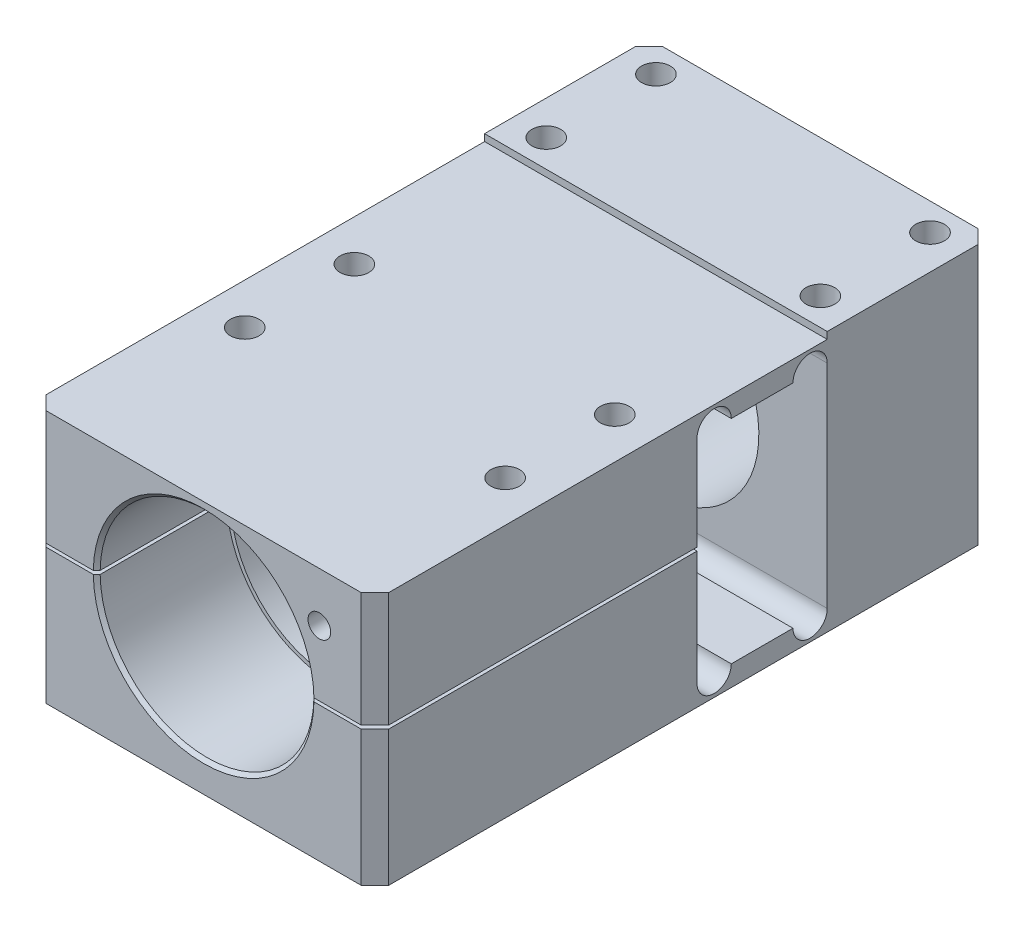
ISO-10303-21;
HEADER;
FILE_DESCRIPTION(('STEP AP214'),'2;1');
FILE_NAME('part.step','',(''),(''),'','','');
FILE_SCHEMA(('AUTOMOTIVE_DESIGN { 1 0 10303 214 1 1 1 1 }'));
ENDSEC;
DATA;
#1=APPLICATION_CONTEXT('core data for automotive mechanical design processes');
#2=APPLICATION_PROTOCOL_DEFINITION('international standard','automotive_design',2000,#1);
#3=PRODUCT_CONTEXT('',#1,'mechanical');
#4=PRODUCT('Part','Part','',(#3));
#5=PRODUCT_RELATED_PRODUCT_CATEGORY('part','',(#4));
#6=PRODUCT_DEFINITION_FORMATION('','',#4);
#7=PRODUCT_DEFINITION_CONTEXT('part definition',#1,'design');
#8=PRODUCT_DEFINITION('design','',#6,#7);
#9=PRODUCT_DEFINITION_SHAPE('','',#8);
#10=(LENGTH_UNIT() NAMED_UNIT(*) SI_UNIT(.MILLI.,.METRE.));
#11=(NAMED_UNIT(*) PLANE_ANGLE_UNIT() SI_UNIT($,.RADIAN.));
#12=(NAMED_UNIT(*) SI_UNIT($,.STERADIAN.) SOLID_ANGLE_UNIT());
#13=UNCERTAINTY_MEASURE_WITH_UNIT(LENGTH_MEASURE(1.E-05),#10,'distance_accuracy_value','');
#14=(GEOMETRIC_REPRESENTATION_CONTEXT(3) GLOBAL_UNCERTAINTY_ASSIGNED_CONTEXT((#13)) GLOBAL_UNIT_ASSIGNED_CONTEXT((#10,
#11,#12)) REPRESENTATION_CONTEXT('',''));
#15=CARTESIAN_POINT('',(0.,0.,0.));
#16=DIRECTION('',(0.,0.,1.));
#17=DIRECTION('',(1.,0.,0.));
#18=AXIS2_PLACEMENT_3D('',#15,#16,#17);
#19=CARTESIAN_POINT('',(53.0779439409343,0.25,40.));
#20=DIRECTION('',(0.,1.,0.));
#21=DIRECTION('',(0.,0.,1.));
#22=AXIS2_PLACEMENT_3D('',#19,#20,#21);
#23=PLANE('',#22);
#24=DIRECTION('',(-1.,0.,0.));
#25=VECTOR('',#24,1.);
#26=CARTESIAN_POINT('',(53.0779439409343,0.25,90.));
#27=LINE('',#26,#25);
#28=CARTESIAN_POINT('',(23.,0.25,90.));
#29=VERTEX_POINT('',#28);
#30=CARTESIAN_POINT('',(16.0980588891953,0.25,90.));
#31=VERTEX_POINT('',#30);
#32=EDGE_CURVE('E425',#29,#31,#27,.T.);
#33=ORIENTED_EDGE('',*,*,#32,.T.);
#34=CARTESIAN_POINT('',(16.0980588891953,0.25,90.));
#35=CARTESIAN_POINT('',(16.0147153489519,0.25,89.9166665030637));
#36=CARTESIAN_POINT('',(15.9313717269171,0.25,89.8333330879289));
#37=CARTESIAN_POINT('',(15.764684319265,0.25,89.6666664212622));
#38=CARTESIAN_POINT('',(15.6813405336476,0.25,89.5833331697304));
#39=CARTESIAN_POINT('',(15.5979966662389,0.25,89.5));
#40=B_SPLINE_CURVE_WITH_KNOTS('',3,(#34,#35,#36,#37,#38,#39),.UNSPECIFIED.,.F.,.F.,(4,2,4),(0.,
0.353575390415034,0.707150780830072),.UNSPECIFIED.);
#41=CARTESIAN_POINT('',(15.5979966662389,0.25,89.5));
#42=VERTEX_POINT('',#41);
#43=EDGE_CURVE('E74',#31,#42,#40,.T.);
#44=ORIENTED_EDGE('',*,*,#43,.T.);
#45=DIRECTION('',(0.,0.,-1.));
#46=VECTOR('',#45,1.);
#47=CARTESIAN_POINT('',(15.5979966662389,0.25,-10.512380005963));
#48=LINE('',#47,#46);
#49=CARTESIAN_POINT('',(15.5979966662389,0.25,71.));
#50=VERTEX_POINT('',#49);
#51=EDGE_CURVE('E443',#50,#42,#48,.F.);
#52=ORIENTED_EDGE('',*,*,#51,.F.);
#53=DIRECTION('',(1.,0.,0.));
#54=VECTOR('',#53,1.);
#55=CARTESIAN_POINT('',(0.,0.25,71.));
#56=LINE('',#55,#54);
#57=CARTESIAN_POINT('',(15.0229199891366,0.25,71.));
#58=VERTEX_POINT('',#57);
#59=EDGE_CURVE('E436',#58,#50,#56,.T.);
#60=ORIENTED_EDGE('',*,*,#59,.F.);
#61=DIRECTION('',(0.,0.,-1.));
#62=VECTOR('',#61,1.);
#63=CARTESIAN_POINT('',(15.0229199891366,0.25,-10.512380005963));
#64=LINE('',#63,#62);
#65=CARTESIAN_POINT('',(15.0229199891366,0.25,43.));
#66=VERTEX_POINT('',#65);
#67=EDGE_CURVE('E438',#66,#58,#64,.F.);
#68=ORIENTED_EDGE('',*,*,#67,.F.);
#69=DIRECTION('',(-1.,0.,0.));
#70=VECTOR('',#69,1.);
#71=CARTESIAN_POINT('',(-25.,0.25,43.));
#72=LINE('',#71,#70);
#73=CARTESIAN_POINT('',(25.,0.25,43.));
#74=VERTEX_POINT('',#73);
#75=EDGE_CURVE('E628',#74,#66,#72,.T.);
#76=ORIENTED_EDGE('',*,*,#75,.F.);
#77=DIRECTION('',(0.,0.,-1.));
#78=VECTOR('',#77,1.);
#79=CARTESIAN_POINT('',(25.,0.25,90.));
#80=LINE('',#79,#78);
#81=CARTESIAN_POINT('',(25.,0.25,88.));
#82=VERTEX_POINT('',#81);
#83=EDGE_CURVE('E441',#82,#74,#80,.T.);
#84=ORIENTED_EDGE('',*,*,#83,.F.);
#85=DIRECTION('',(-0.707106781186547,0.,0.707106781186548));
#86=VECTOR('',#85,1.);
#87=CARTESIAN_POINT('',(23.,0.25,90.));
#88=LINE('',#87,#86);
#89=EDGE_CURVE('E677',#82,#29,#88,.T.);
#90=ORIENTED_EDGE('',*,*,#89,.T.);
#91=EDGE_LOOP('',(#33,#44,#52,#60,#68,#76,#84,#90));
#92=FACE_BOUND('',#91,.T.);
#93=CARTESIAN_POINT('',(19.,0.249999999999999,49.));
#94=DIRECTION('',(0.,-1.,0.));
#95=DIRECTION('',(0.,0.,-1.));
#96=AXIS2_PLACEMENT_3D('',#93,#94,#95);
#97=CIRCLE('',#96,2.09999999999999);
#98=CARTESIAN_POINT('',(19.,0.249999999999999,46.9));
#99=VERTEX_POINT('',#98);
#100=EDGE_CURVE('E366',#99,#99,#97,.T.);
#101=ORIENTED_EDGE('',*,*,#100,.F.);
#102=EDGE_LOOP('',(#101));
#103=FACE_BOUND('',#102,.T.);
#104=CARTESIAN_POINT('',(19.,0.249999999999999,65.));
#105=DIRECTION('',(0.,-1.,0.));
#106=DIRECTION('',(0.,0.,-1.));
#107=AXIS2_PLACEMENT_3D('',#104,#105,#106);
#108=CIRCLE('',#107,2.09999999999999);
#109=CARTESIAN_POINT('',(19.,0.249999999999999,62.9));
#110=VERTEX_POINT('',#109);
#111=EDGE_CURVE('E360',#110,#110,#108,.T.);
#112=ORIENTED_EDGE('',*,*,#111,.F.);
#113=EDGE_LOOP('',(#112));
#114=FACE_BOUND('',#113,.T.);
#115=ADVANCED_FACE('F51',(#92,#103,#114),#23,.F.);
#116=CARTESIAN_POINT('',(-25.,-20.,90.));
#117=DIRECTION('',(0.,1.,0.));
#118=DIRECTION('',(-1.,0.,0.));
#119=AXIS2_PLACEMENT_3D('',#116,#117,#118);
#120=PLANE('',#119);
#121=CARTESIAN_POINT('',(19.,-20.,65.));
#122=DIRECTION('',(0.,-1.,0.));
#123=DIRECTION('',(0.,0.,-1.));
#124=AXIS2_PLACEMENT_3D('',#121,#122,#123);
#125=CIRCLE('',#124,5.);
#126=CARTESIAN_POINT('',(19.,-20.,60.));
#127=VERTEX_POINT('',#126);
#128=EDGE_CURVE('E392',#127,#127,#125,.T.);
#129=ORIENTED_EDGE('',*,*,#128,.F.);
#130=EDGE_LOOP('',(#129));
#131=FACE_BOUND('',#130,.T.);
#132=DIRECTION('',(1.,0.,0.));
#133=VECTOR('',#132,1.);
#134=CARTESIAN_POINT('',(-25.,-20.,90.));
#135=LINE('',#134,#133);
#136=CARTESIAN_POINT('',(-23.,-20.,90.));
#137=VERTEX_POINT('',#136);
#138=CARTESIAN_POINT('',(23.,-20.,90.));
#139=VERTEX_POINT('',#138);
#140=EDGE_CURVE('E563',#137,#139,#135,.T.);
#141=ORIENTED_EDGE('',*,*,#140,.F.);
#142=DIRECTION('',(-0.707106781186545,0.,-0.70710678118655));
#143=VECTOR('',#142,1.);
#144=CARTESIAN_POINT('',(-23.,-20.,90.));
#145=LINE('',#144,#143);
#146=CARTESIAN_POINT('',(-25.,-20.,88.));
#147=VERTEX_POINT('',#146);
#148=EDGE_CURVE('E663',#137,#147,#145,.T.);
#149=ORIENTED_EDGE('',*,*,#148,.T.);
#150=DIRECTION('',(0.,0.,-1.));
#151=VECTOR('',#150,1.);
#152=CARTESIAN_POINT('',(-25.,-20.,90.));
#153=LINE('',#152,#151);
#154=CARTESIAN_POINT('',(-25.,-20.,2.00000000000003));
#155=VERTEX_POINT('',#154);
#156=EDGE_CURVE('E580',#147,#155,#153,.T.);
#157=ORIENTED_EDGE('',*,*,#156,.T.);
#158=DIRECTION('',(-0.707106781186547,0.,0.707106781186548));
#159=VECTOR('',#158,1.);
#160=CARTESIAN_POINT('',(-25.,-20.,2.));
#161=LINE('',#160,#159);
#162=CARTESIAN_POINT('',(-23.,-20.,0.));
#163=VERTEX_POINT('',#162);
#164=EDGE_CURVE('E657',#155,#163,#161,.F.);
#165=ORIENTED_EDGE('',*,*,#164,.T.);
#166=DIRECTION('',(1.,0.,0.));
#167=VECTOR('',#166,1.);
#168=CARTESIAN_POINT('',(-25.,-20.,0.));
#169=LINE('',#168,#167);
#170=CARTESIAN_POINT('',(23.,-20.,0.));
#171=VERTEX_POINT('',#170);
#172=EDGE_CURVE('E562',#163,#171,#169,.T.);
#173=ORIENTED_EDGE('',*,*,#172,.T.);
#174=DIRECTION('',(-0.707106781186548,0.,-0.707106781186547));
#175=VECTOR('',#174,1.);
#176=CARTESIAN_POINT('',(25.,-20.,2.));
#177=LINE('',#176,#175);
#178=CARTESIAN_POINT('',(25.,-20.,2.00000000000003));
#179=VERTEX_POINT('',#178);
#180=EDGE_CURVE('E659',#171,#179,#177,.F.);
#181=ORIENTED_EDGE('',*,*,#180,.T.);
#182=DIRECTION('',(0.,0.,-1.));
#183=VECTOR('',#182,1.);
#184=CARTESIAN_POINT('',(25.,-20.,90.));
#185=LINE('',#184,#183);
#186=CARTESIAN_POINT('',(25.,-20.,88.));
#187=VERTEX_POINT('',#186);
#188=EDGE_CURVE('E577',#187,#179,#185,.T.);
#189=ORIENTED_EDGE('',*,*,#188,.F.);
#190=DIRECTION('',(-0.707106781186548,0.,0.707106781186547));
#191=VECTOR('',#190,1.);
#192=CARTESIAN_POINT('',(23.,-20.,90.));
#193=LINE('',#192,#191);
#194=EDGE_CURVE('E661',#187,#139,#193,.T.);
#195=ORIENTED_EDGE('',*,*,#194,.T.);
#196=EDGE_LOOP('',(#141,#149,#157,#165,#173,#181,#189,#195));
#197=FACE_BOUND('',#196,.T.);
#198=CARTESIAN_POINT('',(19.,-20.,49.));
#199=DIRECTION('',(0.,-1.,0.));
#200=DIRECTION('',(0.,0.,-1.));
#201=AXIS2_PLACEMENT_3D('',#198,#199,#200);
#202=CIRCLE('',#201,5.);
#203=CARTESIAN_POINT('',(19.,-20.,44.));
#204=VERTEX_POINT('',#203);
#205=EDGE_CURVE('E408',#204,#204,#202,.T.);
#206=ORIENTED_EDGE('',*,*,#205,.F.);
#207=EDGE_LOOP('',(#206));
#208=FACE_BOUND('',#207,.T.);
#209=CARTESIAN_POINT('',(-19.,-20.,65.));
#210=DIRECTION('',(0.,-1.,0.));
#211=DIRECTION('',(0.,0.,-1.));
#212=AXIS2_PLACEMENT_3D('',#209,#210,#211);
#213=CIRCLE('',#212,5.);
#214=CARTESIAN_POINT('',(-19.,-20.,60.));
#215=VERTEX_POINT('',#214);
#216=EDGE_CURVE('E380',#215,#215,#213,.T.);
#217=ORIENTED_EDGE('',*,*,#216,.F.);
#218=EDGE_LOOP('',(#217));
#219=FACE_BOUND('',#218,.T.);
#220=CARTESIAN_POINT('',(-19.,-20.,49.));
#221=DIRECTION('',(0.,-1.,0.));
#222=DIRECTION('',(0.,0.,-1.));
#223=AXIS2_PLACEMENT_3D('',#220,#221,#222);
#224=CIRCLE('',#223,5.);
#225=CARTESIAN_POINT('',(-19.,-20.,44.));
#226=VERTEX_POINT('',#225);
#227=EDGE_CURVE('E372',#226,#226,#224,.T.);
#228=ORIENTED_EDGE('',*,*,#227,.F.);
#229=EDGE_LOOP('',(#228));
#230=FACE_BOUND('',#229,.T.);
#231=ADVANCED_FACE('F729',(#131,#197,#208,#219,#230),#120,.F.);
#232=CARTESIAN_POINT('',(53.0779439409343,-0.25,40.));
#233=DIRECTION('',(0.,1.,0.));
#234=DIRECTION('',(0.,0.,1.));
#235=AXIS2_PLACEMENT_3D('',#232,#233,#234);
#236=PLANE('',#235);
#237=DIRECTION('',(-1.,0.,0.));
#238=VECTOR('',#237,1.);
#239=CARTESIAN_POINT('',(53.0779439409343,-0.25,90.));
#240=LINE('',#239,#238);
#241=CARTESIAN_POINT('',(-16.0980588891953,-0.25,90.));
#242=VERTEX_POINT('',#241);
#243=CARTESIAN_POINT('',(-23.,-0.25,90.));
#244=VERTEX_POINT('',#243);
#245=EDGE_CURVE('E420',#242,#244,#240,.T.);
#246=ORIENTED_EDGE('',*,*,#245,.F.);
#247=CARTESIAN_POINT('',(-16.0980588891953,-0.25,90.));
#248=CARTESIAN_POINT('',(-16.0147153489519,-0.25,89.9166665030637));
#249=CARTESIAN_POINT('',(-15.9313717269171,-0.25,89.8333330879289));
#250=CARTESIAN_POINT('',(-15.764684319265,-0.25,89.6666664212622));
#251=CARTESIAN_POINT('',(-15.6813405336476,-0.25,89.5833331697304));
#252=CARTESIAN_POINT('',(-15.5979966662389,-0.25,89.5));
#253=B_SPLINE_CURVE_WITH_KNOTS('',3,(#247,#248,#249,#250,#251,#252),.UNSPECIFIED.,.F.,.F.,(4,2,
4),(0.,0.353575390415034,0.707150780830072),.UNSPECIFIED.);
#254=CARTESIAN_POINT('',(-15.5979966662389,-0.25,89.5));
#255=VERTEX_POINT('',#254);
#256=EDGE_CURVE('E690',#242,#255,#253,.T.);
#257=ORIENTED_EDGE('',*,*,#256,.T.);
#258=DIRECTION('',(0.,0.,-1.));
#259=VECTOR('',#258,1.);
#260=CARTESIAN_POINT('',(-15.5979966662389,-0.25,-10.512380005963));
#261=LINE('',#260,#259);
#262=CARTESIAN_POINT('',(-15.5979966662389,-0.25,71.));
#263=VERTEX_POINT('',#262);
#264=EDGE_CURVE('E452',#255,#263,#261,.T.);
#265=ORIENTED_EDGE('',*,*,#264,.T.);
#266=DIRECTION('',(1.,0.,0.));
#267=VECTOR('',#266,1.);
#268=CARTESIAN_POINT('',(0.,-0.25,71.));
#269=LINE('',#268,#267);
#270=CARTESIAN_POINT('',(-15.0229199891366,-0.25,71.));
#271=VERTEX_POINT('',#270);
#272=EDGE_CURVE('E450',#263,#271,#269,.T.);
#273=ORIENTED_EDGE('',*,*,#272,.T.);
#274=DIRECTION('',(0.,0.,-1.));
#275=VECTOR('',#274,1.);
#276=CARTESIAN_POINT('',(-15.0229199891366,-0.25,-10.512380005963));
#277=LINE('',#276,#275);
#278=CARTESIAN_POINT('',(-15.0229199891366,-0.25,43.));
#279=VERTEX_POINT('',#278);
#280=EDGE_CURVE('E445',#271,#279,#277,.T.);
#281=ORIENTED_EDGE('',*,*,#280,.T.);
#282=DIRECTION('',(-1.,0.,0.));
#283=VECTOR('',#282,1.);
#284=CARTESIAN_POINT('',(-25.,-0.25,43.));
#285=LINE('',#284,#283);
#286=CARTESIAN_POINT('',(-25.,-0.25,43.));
#287=VERTEX_POINT('',#286);
#288=EDGE_CURVE('E629',#279,#287,#285,.T.);
#289=ORIENTED_EDGE('',*,*,#288,.T.);
#290=DIRECTION('',(0.,0.,1.));
#291=VECTOR('',#290,1.);
#292=CARTESIAN_POINT('',(-25.,-0.25,90.));
#293=LINE('',#292,#291);
#294=CARTESIAN_POINT('',(-25.,-0.25,88.));
#295=VERTEX_POINT('',#294);
#296=EDGE_CURVE('E447',#287,#295,#293,.T.);
#297=ORIENTED_EDGE('',*,*,#296,.T.);
#298=DIRECTION('',(0.707106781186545,0.,0.70710678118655));
#299=VECTOR('',#298,1.);
#300=CARTESIAN_POINT('',(-9.96102802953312,-0.25,103.038971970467));
#301=LINE('',#300,#299);
#302=EDGE_CURVE('E665',#295,#244,#301,.T.);
#303=ORIENTED_EDGE('',*,*,#302,.T.);
#304=EDGE_LOOP('',(#246,#257,#265,#273,#281,#289,#297,#303));
#305=FACE_BOUND('',#304,.T.);
#306=CARTESIAN_POINT('',(-19.,-0.25,65.));
#307=DIRECTION('',(0.,1.,0.));
#308=DIRECTION('',(0.,0.,1.));
#309=AXIS2_PLACEMENT_3D('',#306,#307,#308);
#310=CIRCLE('',#309,2.75);
#311=CARTESIAN_POINT('',(-19.,-0.25,67.75));
#312=VERTEX_POINT('',#311);
#313=EDGE_CURVE('E389',#312,#312,#310,.F.);
#314=ORIENTED_EDGE('',*,*,#313,.T.);
#315=EDGE_LOOP('',(#314));
#316=FACE_BOUND('',#315,.T.);
#317=CARTESIAN_POINT('',(-19.,-0.25,49.));
#318=DIRECTION('',(0.,1.,0.));
#319=DIRECTION('',(0.,0.,1.));
#320=AXIS2_PLACEMENT_3D('',#317,#318,#319);
#321=CIRCLE('',#320,2.75);
#322=CARTESIAN_POINT('',(-19.,-0.25,51.75));
#323=VERTEX_POINT('',#322);
#324=EDGE_CURVE('E377',#323,#323,#321,.F.);
#325=ORIENTED_EDGE('',*,*,#324,.T.);
#326=EDGE_LOOP('',(#325));
#327=FACE_BOUND('',#326,.T.);
#328=ADVANCED_FACE('F931',(#305,#316,#327),#236,.T.);
#329=CARTESIAN_POINT('',(-25.,18.,90.));
#330=DIRECTION('',(1.,0.,0.));
#331=DIRECTION('',(0.,1.,0.));
#332=AXIS2_PLACEMENT_3D('',#329,#330,#331);
#333=PLANE('',#332);
#334=DIRECTION('',(0.,0.,1.));
#335=VECTOR('',#334,1.);
#336=CARTESIAN_POINT('',(-25.,0.25,90.));
#337=LINE('',#336,#335);
#338=CARTESIAN_POINT('',(-25.,0.25,43.));
#339=VERTEX_POINT('',#338);
#340=CARTESIAN_POINT('',(-25.,0.25,88.));
#341=VERTEX_POINT('',#340);
#342=EDGE_CURVE('E429',#339,#341,#337,.T.);
#343=ORIENTED_EDGE('',*,*,#342,.T.);
#344=DIRECTION('',(0.,1.,0.));
#345=VECTOR('',#344,1.);
#346=CARTESIAN_POINT('',(-25.,17.,88.));
#347=LINE('',#346,#345);
#348=CARTESIAN_POINT('',(-25.,17.,88.));
#349=VERTEX_POINT('',#348);
#350=EDGE_CURVE('E645',#341,#349,#347,.T.);
#351=ORIENTED_EDGE('',*,*,#350,.T.);
#352=DIRECTION('',(0.,0.,-1.));
#353=VECTOR('',#352,1.);
#354=CARTESIAN_POINT('',(-25.,17.,90.));
#355=LINE('',#354,#353);
#356=CARTESIAN_POINT('',(-25.,17.,24.));
#357=VERTEX_POINT('',#356);
#358=EDGE_CURVE('E542',#349,#357,#355,.T.);
#359=ORIENTED_EDGE('',*,*,#358,.T.);
#360=DIRECTION('',(0.,1.,0.));
#361=VECTOR('',#360,1.);
#362=CARTESIAN_POINT('',(-25.,18.,24.));
#363=LINE('',#362,#361);
#364=CARTESIAN_POINT('',(-25.,18.,24.));
#365=VERTEX_POINT('',#364);
#366=EDGE_CURVE('E544',#357,#365,#363,.T.);
#367=ORIENTED_EDGE('',*,*,#366,.T.);
#368=DIRECTION('',(0.,0.,-1.));
#369=VECTOR('',#368,1.);
#370=CARTESIAN_POINT('',(-25.,18.,90.));
#371=LINE('',#370,#369);
#372=CARTESIAN_POINT('',(-25.,18.,2.00000000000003));
#373=VERTEX_POINT('',#372);
#374=EDGE_CURVE('E566',#365,#373,#371,.T.);
#375=ORIENTED_EDGE('',*,*,#374,.T.);
#376=DIRECTION('',(0.,-1.,0.));
#377=VECTOR('',#376,1.);
#378=CARTESIAN_POINT('',(-25.,18.,2.));
#379=LINE('',#378,#377);
#380=EDGE_CURVE('E640',#373,#155,#379,.T.);
#381=ORIENTED_EDGE('',*,*,#380,.T.);
#382=ORIENTED_EDGE('',*,*,#156,.F.);
#383=DIRECTION('',(0.,1.,0.));
#384=VECTOR('',#383,1.);
#385=CARTESIAN_POINT('',(-25.,-0.25,88.));
#386=LINE('',#385,#384);
#387=EDGE_CURVE('E643',#147,#295,#386,.T.);
#388=ORIENTED_EDGE('',*,*,#387,.T.);
#389=ORIENTED_EDGE('',*,*,#296,.F.);
#390=DIRECTION('',(0.,-1.,0.));
#391=VECTOR('',#390,1.);
#392=CARTESIAN_POINT('',(-25.,14.,43.));
#393=LINE('',#392,#391);
#394=CARTESIAN_POINT('',(-25.,-17.,43.));
#395=VERTEX_POINT('',#394);
#396=EDGE_CURVE('E491',#287,#395,#393,.T.);
#397=ORIENTED_EDGE('',*,*,#396,.T.);
#398=CARTESIAN_POINT('',(-25.,-17.,40.5));
#399=DIRECTION('',(1.,0.,0.));
#400=DIRECTION('',(0.,0.,-1.));
#401=AXIS2_PLACEMENT_3D('',#398,#399,#400);
#402=CIRCLE('',#401,2.50000000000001);
#403=CARTESIAN_POINT('',(-25.,-17.,38.));
#404=VERTEX_POINT('',#403);
#405=EDGE_CURVE('E495',#395,#404,#402,.T.);
#406=ORIENTED_EDGE('',*,*,#405,.T.);
#407=DIRECTION('',(0.,0.,-1.));
#408=VECTOR('',#407,1.);
#409=CARTESIAN_POINT('',(-25.,-17.,38.));
#410=LINE('',#409,#408);
#411=CARTESIAN_POINT('',(-25.,-17.,29.));
#412=VERTEX_POINT('',#411);
#413=EDGE_CURVE('E498',#404,#412,#410,.T.);
#414=ORIENTED_EDGE('',*,*,#413,.T.);
#415=CARTESIAN_POINT('',(-25.,-17.,26.5));
#416=DIRECTION('',(1.,0.,0.));
#417=DIRECTION('',(0.,0.,1.));
#418=AXIS2_PLACEMENT_3D('',#415,#416,#417);
#419=CIRCLE('',#418,2.5);
#420=CARTESIAN_POINT('',(-25.,-17.,24.));
#421=VERTEX_POINT('',#420);
#422=EDGE_CURVE('E501',#412,#421,#419,.T.);
#423=ORIENTED_EDGE('',*,*,#422,.T.);
#424=DIRECTION('',(0.,1.,0.));
#425=VECTOR('',#424,1.);
#426=CARTESIAN_POINT('',(-25.,14.,24.));
#427=LINE('',#426,#425);
#428=CARTESIAN_POINT('',(-25.,14.,24.));
#429=VERTEX_POINT('',#428);
#430=EDGE_CURVE('E504',#421,#429,#427,.T.);
#431=ORIENTED_EDGE('',*,*,#430,.T.);
#432=CARTESIAN_POINT('',(-25.,14.,26.5));
#433=DIRECTION('',(1.,0.,0.));
#434=DIRECTION('',(0.,0.,-1.));
#435=AXIS2_PLACEMENT_3D('',#432,#433,#434);
#436=CIRCLE('',#435,2.5);
#437=CARTESIAN_POINT('',(-25.,14.,29.));
#438=VERTEX_POINT('',#437);
#439=EDGE_CURVE('E507',#429,#438,#436,.T.);
#440=ORIENTED_EDGE('',*,*,#439,.T.);
#441=DIRECTION('',(0.,0.,1.));
#442=VECTOR('',#441,1.);
#443=CARTESIAN_POINT('',(-25.,14.,38.));
#444=LINE('',#443,#442);
#445=CARTESIAN_POINT('',(-25.,14.,38.));
#446=VERTEX_POINT('',#445);
#447=EDGE_CURVE('E510',#438,#446,#444,.T.);
#448=ORIENTED_EDGE('',*,*,#447,.T.);
#449=CARTESIAN_POINT('',(-25.,14.,40.5));
#450=DIRECTION('',(1.,0.,0.));
#451=DIRECTION('',(0.,0.,1.));
#452=AXIS2_PLACEMENT_3D('',#449,#450,#451);
#453=CIRCLE('',#452,2.5);
#454=CARTESIAN_POINT('',(-25.,14.,43.));
#455=VERTEX_POINT('',#454);
#456=EDGE_CURVE('E488',#446,#455,#453,.T.);
#457=ORIENTED_EDGE('',*,*,#456,.T.);
#458=EDGE_CURVE('E492',#455,#339,#393,.T.);
#459=ORIENTED_EDGE('',*,*,#458,.T.);
#460=EDGE_LOOP('',(#343,#351,#359,#367,#375,#381,#382,#388,#389,#397,#406,#414,#423,#431,#440,
#448,#457,#459));
#461=FACE_BOUND('',#460,.T.);
#462=ADVANCED_FACE('F793',(#461),#333,.F.);
#463=CARTESIAN_POINT('',(25.,18.,90.));
#464=DIRECTION('',(-1.,0.,0.));
#465=DIRECTION('',(0.,-1.,0.));
#466=AXIS2_PLACEMENT_3D('',#463,#464,#465);
#467=PLANE('',#466);
#468=DIRECTION('',(0.,0.,-1.));
#469=VECTOR('',#468,1.);
#470=CARTESIAN_POINT('',(25.,-0.25,90.));
#471=LINE('',#470,#469);
#472=CARTESIAN_POINT('',(25.,-0.25,88.));
#473=VERTEX_POINT('',#472);
#474=CARTESIAN_POINT('',(25.,-0.25,43.));
#475=VERTEX_POINT('',#474);
#476=EDGE_CURVE('E457',#473,#475,#471,.T.);
#477=ORIENTED_EDGE('',*,*,#476,.F.);
#478=DIRECTION('',(0.,-1.,0.));
#479=VECTOR('',#478,1.);
#480=CARTESIAN_POINT('',(25.,-20.,88.));
#481=LINE('',#480,#479);
#482=EDGE_CURVE('E675',#473,#187,#481,.T.);
#483=ORIENTED_EDGE('',*,*,#482,.T.);
#484=ORIENTED_EDGE('',*,*,#188,.T.);
#485=DIRECTION('',(0.,1.,0.));
#486=VECTOR('',#485,1.);
#487=CARTESIAN_POINT('',(25.,18.,2.));
#488=LINE('',#487,#486);
#489=CARTESIAN_POINT('',(25.,18.,2.00000000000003));
#490=VERTEX_POINT('',#489);
#491=EDGE_CURVE('E670',#179,#490,#488,.T.);
#492=ORIENTED_EDGE('',*,*,#491,.T.);
#493=DIRECTION('',(0.,0.,-1.));
#494=VECTOR('',#493,1.);
#495=CARTESIAN_POINT('',(25.,18.,90.));
#496=LINE('',#495,#494);
#497=CARTESIAN_POINT('',(25.,18.,24.));
#498=VERTEX_POINT('',#497);
#499=EDGE_CURVE('E574',#498,#490,#496,.T.);
#500=ORIENTED_EDGE('',*,*,#499,.F.);
#501=DIRECTION('',(0.,1.,0.));
#502=VECTOR('',#501,1.);
#503=CARTESIAN_POINT('',(25.,18.,24.));
#504=LINE('',#503,#502);
#505=CARTESIAN_POINT('',(25.,17.,24.));
#506=VERTEX_POINT('',#505);
#507=EDGE_CURVE('E540',#506,#498,#504,.T.);
#508=ORIENTED_EDGE('',*,*,#507,.F.);
#509=DIRECTION('',(0.,0.,-1.));
#510=VECTOR('',#509,1.);
#511=CARTESIAN_POINT('',(25.,17.,90.));
#512=LINE('',#511,#510);
#513=CARTESIAN_POINT('',(25.,17.,88.));
#514=VERTEX_POINT('',#513);
#515=EDGE_CURVE('E462',#514,#506,#512,.T.);
#516=ORIENTED_EDGE('',*,*,#515,.F.);
#517=DIRECTION('',(0.,-1.,0.));
#518=VECTOR('',#517,1.);
#519=CARTESIAN_POINT('',(25.,0.25,88.));
#520=LINE('',#519,#518);
#521=EDGE_CURVE('E673',#514,#82,#520,.T.);
#522=ORIENTED_EDGE('',*,*,#521,.T.);
#523=ORIENTED_EDGE('',*,*,#83,.T.);
#524=DIRECTION('',(0.,-1.,0.));
#525=VECTOR('',#524,1.);
#526=CARTESIAN_POINT('',(25.,14.,43.));
#527=LINE('',#526,#525);
#528=CARTESIAN_POINT('',(25.,14.,43.));
#529=VERTEX_POINT('',#528);
#530=EDGE_CURVE('E467',#529,#74,#527,.T.);
#531=ORIENTED_EDGE('',*,*,#530,.F.);
#532=CARTESIAN_POINT('',(25.,14.,40.5));
#533=DIRECTION('',(1.,0.,0.));
#534=DIRECTION('',(0.,0.,1.));
#535=AXIS2_PLACEMENT_3D('',#532,#533,#534);
#536=CIRCLE('',#535,2.5);
#537=CARTESIAN_POINT('',(25.,14.,38.));
#538=VERTEX_POINT('',#537);
#539=EDGE_CURVE('E463',#538,#529,#536,.T.);
#540=ORIENTED_EDGE('',*,*,#539,.F.);
#541=DIRECTION('',(0.,0.,1.));
#542=VECTOR('',#541,1.);
#543=CARTESIAN_POINT('',(25.,14.,38.));
#544=LINE('',#543,#542);
#545=CARTESIAN_POINT('',(25.,14.,29.));
#546=VERTEX_POINT('',#545);
#547=EDGE_CURVE('E485',#546,#538,#544,.T.);
#548=ORIENTED_EDGE('',*,*,#547,.F.);
#549=CARTESIAN_POINT('',(25.,14.,26.5));
#550=DIRECTION('',(1.,0.,0.));
#551=DIRECTION('',(0.,0.,-1.));
#552=AXIS2_PLACEMENT_3D('',#549,#550,#551);
#553=CIRCLE('',#552,2.5);
#554=CARTESIAN_POINT('',(25.,14.,24.));
#555=VERTEX_POINT('',#554);
#556=EDGE_CURVE('E482',#555,#546,#553,.T.);
#557=ORIENTED_EDGE('',*,*,#556,.F.);
#558=DIRECTION('',(0.,1.,0.));
#559=VECTOR('',#558,1.);
#560=CARTESIAN_POINT('',(25.,14.,24.));
#561=LINE('',#560,#559);
#562=CARTESIAN_POINT('',(25.,-17.,24.));
#563=VERTEX_POINT('',#562);
#564=EDGE_CURVE('E479',#563,#555,#561,.T.);
#565=ORIENTED_EDGE('',*,*,#564,.F.);
#566=CARTESIAN_POINT('',(25.,-17.,26.5));
#567=DIRECTION('',(1.,0.,0.));
#568=DIRECTION('',(0.,0.,1.));
#569=AXIS2_PLACEMENT_3D('',#566,#567,#568);
#570=CIRCLE('',#569,2.5);
#571=CARTESIAN_POINT('',(25.,-17.,29.));
#572=VERTEX_POINT('',#571);
#573=EDGE_CURVE('E476',#572,#563,#570,.T.);
#574=ORIENTED_EDGE('',*,*,#573,.F.);
#575=DIRECTION('',(0.,0.,-1.));
#576=VECTOR('',#575,1.);
#577=CARTESIAN_POINT('',(25.,-17.,38.));
#578=LINE('',#577,#576);
#579=CARTESIAN_POINT('',(25.,-17.,38.));
#580=VERTEX_POINT('',#579);
#581=EDGE_CURVE('E473',#580,#572,#578,.T.);
#582=ORIENTED_EDGE('',*,*,#581,.F.);
#583=CARTESIAN_POINT('',(25.,-17.,40.5));
#584=DIRECTION('',(1.,0.,0.));
#585=DIRECTION('',(0.,0.,-1.));
#586=AXIS2_PLACEMENT_3D('',#583,#584,#585);
#587=CIRCLE('',#586,2.50000000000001);
#588=CARTESIAN_POINT('',(25.,-17.,43.));
#589=VERTEX_POINT('',#588);
#590=EDGE_CURVE('E470',#589,#580,#587,.T.);
#591=ORIENTED_EDGE('',*,*,#590,.F.);
#592=EDGE_CURVE('E465',#475,#589,#527,.T.);
#593=ORIENTED_EDGE('',*,*,#592,.F.);
#594=EDGE_LOOP('',(#477,#483,#484,#492,#500,#508,#516,#522,#523,#531,#540,#548,#557,#565,#574,
#582,#591,#593));
#595=FACE_BOUND('',#594,.T.);
#596=ADVANCED_FACE('F774',(#595),#467,.F.);
#597=CARTESIAN_POINT('',(0.,0.,90.));
#598=DIRECTION('',(0.,0.,1.));
#599=DIRECTION('',(1.,0.,0.));
#600=AXIS2_PLACEMENT_3D('',#597,#598,#599);
#601=PLANE('',#600);
#602=CARTESIAN_POINT('',(23.,-0.25,90.));
#603=VERTEX_POINT('',#602);
#604=CARTESIAN_POINT('',(16.0980588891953,-0.25,90.));
#605=VERTEX_POINT('',#604);
#606=EDGE_CURVE('E422',#603,#605,#240,.T.);
#607=ORIENTED_EDGE('',*,*,#606,.T.);
#608=CARTESIAN_POINT('',(0.,0.,90.));
#609=DIRECTION('',(0.,0.,1.));
#610=DIRECTION('',(1.,0.,0.));
#611=AXIS2_PLACEMENT_3D('',#608,#609,#610);
#612=CIRCLE('',#611,16.1);
#613=EDGE_CURVE('E687',#605,#242,#612,.F.);
#614=ORIENTED_EDGE('',*,*,#613,.T.);
#615=ORIENTED_EDGE('',*,*,#245,.T.);
#616=DIRECTION('',(0.,-1.,0.));
#617=VECTOR('',#616,1.);
#618=CARTESIAN_POINT('',(-23.,-20.,90.));
#619=LINE('',#618,#617);
#620=EDGE_CURVE('E654',#244,#137,#619,.T.);
#621=ORIENTED_EDGE('',*,*,#620,.T.);
#622=ORIENTED_EDGE('',*,*,#140,.T.);
#623=DIRECTION('',(0.,1.,0.));
#624=VECTOR('',#623,1.);
#625=CARTESIAN_POINT('',(23.,-0.250000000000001,90.));
#626=LINE('',#625,#624);
#627=EDGE_CURVE('E651',#139,#603,#626,.T.);
#628=ORIENTED_EDGE('',*,*,#627,.T.);
#629=EDGE_LOOP('',(#607,#614,#615,#621,#622,#628));
#630=FACE_BOUND('',#629,.T.);
#631=ADVANCED_FACE('F783',(#630),#601,.T.);
#632=CARTESIAN_POINT('',(0.,0.,-10.512380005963));
#633=DIRECTION('',(0.,0.,-1.));
#634=DIRECTION('',(-1.,0.,0.));
#635=AXIS2_PLACEMENT_3D('',#632,#633,#634);
#636=CYLINDRICAL_SURFACE('',#635,15.025);
#637=DIRECTION('',(0.,0.,-1.));
#638=VECTOR('',#637,1.);
#639=CARTESIAN_POINT('',(15.0229199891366,-0.25,-10.512380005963));
#640=LINE('',#639,#638);
#641=CARTESIAN_POINT('',(15.0229199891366,-0.25,43.));
#642=VERTEX_POINT('',#641);
#643=CARTESIAN_POINT('',(15.0229199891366,-0.25,71.));
#644=VERTEX_POINT('',#643);
#645=EDGE_CURVE('E455',#642,#644,#640,.F.);
#646=ORIENTED_EDGE('',*,*,#645,.F.);
#647=CARTESIAN_POINT('',(0.,0.,43.));
#648=DIRECTION('',(0.,0.,1.));
#649=DIRECTION('',(1.,0.,0.));
#650=AXIS2_PLACEMENT_3D('',#647,#648,#649);
#651=CIRCLE('',#650,15.025);
#652=EDGE_CURVE('E588',#642,#279,#651,.F.);
#653=ORIENTED_EDGE('',*,*,#652,.T.);
#654=ORIENTED_EDGE('',*,*,#280,.F.);
#655=CARTESIAN_POINT('',(0.,0.,71.));
#656=DIRECTION('',(0.,0.,-1.));
#657=DIRECTION('',(-1.,0.,0.));
#658=AXIS2_PLACEMENT_3D('',#655,#656,#657);
#659=CIRCLE('',#658,15.025);
#660=EDGE_CURVE('E558',#644,#271,#659,.T.);
#661=ORIENTED_EDGE('',*,*,#660,.F.);
#662=EDGE_LOOP('',(#646,#653,#654,#661));
#663=FACE_BOUND('',#662,.T.);
#664=ADVANCED_FACE('F875',(#663),#636,.F.);
#665=CARTESIAN_POINT('',(0.,15.025,71.));
#666=DIRECTION('',(0.,0.,-1.));
#667=DIRECTION('',(-1.,0.,0.));
#668=AXIS2_PLACEMENT_3D('',#665,#666,#667);
#669=PLANE('',#668);
#670=ORIENTED_EDGE('',*,*,#272,.F.);
#671=CARTESIAN_POINT('',(0.,0.,71.));
#672=DIRECTION('',(0.,0.,-1.));
#673=DIRECTION('',(-1.,0.,0.));
#674=AXIS2_PLACEMENT_3D('',#671,#672,#673);
#675=CIRCLE('',#674,15.6);
#676=CARTESIAN_POINT('',(15.5979966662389,-0.25,71.));
#677=VERTEX_POINT('',#676);
#678=EDGE_CURVE('E517',#677,#263,#675,.T.);
#679=ORIENTED_EDGE('',*,*,#678,.F.);
#680=EDGE_CURVE('E453',#644,#677,#269,.T.);
#681=ORIENTED_EDGE('',*,*,#680,.F.);
#682=ORIENTED_EDGE('',*,*,#660,.T.);
#683=EDGE_LOOP('',(#670,#679,#681,#682));
#684=FACE_BOUND('',#683,.T.);
#685=ADVANCED_FACE('F911',(#684),#669,.F.);
#686=CARTESIAN_POINT('',(0.,0.,-10.512380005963));
#687=DIRECTION('',(0.,0.,-1.));
#688=DIRECTION('',(-1.,0.,0.));
#689=AXIS2_PLACEMENT_3D('',#686,#687,#688);
#690=CYLINDRICAL_SURFACE('',#689,15.6);
#691=ORIENTED_EDGE('',*,*,#264,.F.);
#692=CARTESIAN_POINT('',(0.,0.,89.5));
#693=DIRECTION('',(0.,0.,1.));
#694=DIRECTION('',(1.,0.,0.));
#695=AXIS2_PLACEMENT_3D('',#692,#693,#694);
#696=CIRCLE('',#695,15.6);
#697=CARTESIAN_POINT('',(15.5979966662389,-0.25,89.5));
#698=VERTEX_POINT('',#697);
#699=EDGE_CURVE('E697',#255,#698,#696,.T.);
#700=ORIENTED_EDGE('',*,*,#699,.T.);
#701=DIRECTION('',(0.,0.,-1.));
#702=VECTOR('',#701,1.);
#703=CARTESIAN_POINT('',(15.5979966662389,-0.25,-10.512380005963));
#704=LINE('',#703,#702);
#705=EDGE_CURVE('E459',#677,#698,#704,.F.);
#706=ORIENTED_EDGE('',*,*,#705,.F.);
#707=ORIENTED_EDGE('',*,*,#678,.T.);
#708=EDGE_LOOP('',(#691,#700,#706,#707));
#709=FACE_BOUND('',#708,.T.);
#710=ADVANCED_FACE('F918',(#709),#690,.F.);
#711=CARTESIAN_POINT('',(-25.,14.,43.));
#712=DIRECTION('',(0.,0.,1.));
#713=DIRECTION('',(1.,0.,0.));
#714=AXIS2_PLACEMENT_3D('',#711,#712,#713);
#715=PLANE('',#714);
#716=EDGE_CURVE('E631',#475,#642,#285,.T.);
#717=ORIENTED_EDGE('',*,*,#716,.F.);
#718=ORIENTED_EDGE('',*,*,#592,.T.);
#719=DIRECTION('',(1.,0.,0.));
#720=VECTOR('',#719,1.);
#721=CARTESIAN_POINT('',(-25.,-17.,43.));
#722=LINE('',#721,#720);
#723=EDGE_CURVE('E533',#395,#589,#722,.T.);
#724=ORIENTED_EDGE('',*,*,#723,.F.);
#725=ORIENTED_EDGE('',*,*,#396,.F.);
#726=ORIENTED_EDGE('',*,*,#288,.F.);
#727=ORIENTED_EDGE('',*,*,#652,.F.);
#728=EDGE_LOOP('',(#717,#718,#724,#725,#726,#727));
#729=FACE_BOUND('',#728,.T.);
#730=ADVANCED_FACE('F886',(#729),#715,.F.);
#731=ORIENTED_EDGE('',*,*,#530,.T.);
#732=ORIENTED_EDGE('',*,*,#75,.T.);
#733=CARTESIAN_POINT('',(5.45441335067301,14.,43.));
#734=VERTEX_POINT('',#733);
#735=EDGE_CURVE('E584',#734,#66,#651,.F.);
#736=ORIENTED_EDGE('',*,*,#735,.F.);
#737=DIRECTION('',(1.,0.,0.));
#738=VECTOR('',#737,1.);
#739=CARTESIAN_POINT('',(-25.,14.,43.));
#740=LINE('',#739,#738);
#741=EDGE_CURVE('E513',#734,#529,#740,.T.);
#742=ORIENTED_EDGE('',*,*,#741,.T.);
#743=EDGE_LOOP('',(#731,#732,#736,#742));
#744=FACE_BOUND('',#743,.T.);
#745=ADVANCED_FACE('F828',(#744),#715,.F.);
#746=CARTESIAN_POINT('',(0.,0.,0.499999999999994));
#747=DIRECTION('',(0.,0.,1.));
#748=DIRECTION('',(1.,0.,0.));
#749=AXIS2_PLACEMENT_3D('',#746,#747,#748);
#750=CIRCLE('',#749,15.025);
#751=CARTESIAN_POINT('',(15.025,0.,0.499999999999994));
#752=VERTEX_POINT('',#751);
#753=EDGE_CURVE('E59',#752,#752,#750,.F.);
#754=ORIENTED_EDGE('',*,*,#753,.T.);
#755=EDGE_LOOP('',(#754));
#756=FACE_BOUND('',#755,.T.);
#757=CARTESIAN_POINT('',(0.,0.,24.));
#758=DIRECTION('',(0.,0.,-1.));
#759=DIRECTION('',(0.,1.,0.));
#760=AXIS2_PLACEMENT_3D('',#757,#758,#759);
#761=CIRCLE('',#760,15.025);
#762=CARTESIAN_POINT('',(-5.45441335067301,14.,24.));
#763=VERTEX_POINT('',#762);
#764=CARTESIAN_POINT('',(5.45441335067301,14.,24.));
#765=VERTEX_POINT('',#764);
#766=EDGE_CURVE('E596',#763,#765,#761,.F.);
#767=ORIENTED_EDGE('',*,*,#766,.T.);
#768=CARTESIAN_POINT('',(-5.454413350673,14.,24.));
#769=CARTESIAN_POINT('',(-5.65131485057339,13.9232870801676,24.0000008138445));
#770=CARTESIAN_POINT('',(-5.84660315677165,13.8424154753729,24.0035155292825));
#771=CARTESIAN_POINT('',(-6.23335573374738,13.6726184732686,24.0200592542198));
#772=CARTESIAN_POINT('',(-6.42481884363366,13.5836906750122,24.0330911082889));
#773=CARTESIAN_POINT('',(-6.80213288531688,13.3987156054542,24.0715536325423));
#774=CARTESIAN_POINT('',(-6.98800274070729,13.3026973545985,24.0969359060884));
#775=CARTESIAN_POINT('',(-7.35329039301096,13.1043057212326,24.1636167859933));
#776=CARTESIAN_POINT('',(-7.53271458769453,13.0019389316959,24.2048991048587));
#777=CARTESIAN_POINT('',(-7.84715090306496,12.8140243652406,24.2972616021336));
#778=CARTESIAN_POINT('',(-7.98374433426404,12.7293158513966,24.3446140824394));
#779=CARTESIAN_POINT('',(-8.24988753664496,12.558461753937,24.4549276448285));
#780=CARTESIAN_POINT('',(-8.37943087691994,12.4723149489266,24.5179026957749));
#781=CARTESIAN_POINT('',(-8.62981966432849,12.3004099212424,24.6631057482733));
#782=CARTESIAN_POINT('',(-8.75057838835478,12.2146618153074,24.7454985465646));
#783=CARTESIAN_POINT('',(-8.97792484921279,12.0485340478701,24.9324094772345));
#784=CARTESIAN_POINT('',(-9.0845433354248,11.9681429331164,25.0368782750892));
#785=CARTESIAN_POINT('',(-9.24592948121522,11.8435724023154,25.2317572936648));
#786=CARTESIAN_POINT('',(-9.30622318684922,11.7961740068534,25.3155077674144));
#787=CARTESIAN_POINT('',(-9.41540022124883,11.7092150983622,25.4939505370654));
#788=CARTESIAN_POINT('',(-9.46428786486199,11.6696516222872,25.5886386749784));
#789=CARTESIAN_POINT('',(-9.54841533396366,11.6009224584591,25.7888535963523));
#790=CARTESIAN_POINT('',(-9.58350501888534,11.5718714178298,25.8944846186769));
#791=CARTESIAN_POINT('',(-9.63661812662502,11.527681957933,26.1127298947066));
#792=CARTESIAN_POINT('',(-9.65466383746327,11.5125253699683,26.2253348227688));
#793=CARTESIAN_POINT('',(-9.67086818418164,11.4989135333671,26.4362451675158));
#794=CARTESIAN_POINT('',(-9.6715538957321,11.4983360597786,26.5342275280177));
#795=CARTESIAN_POINT('',(-9.6593584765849,11.5085830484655,26.7287234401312));
#796=CARTESIAN_POINT('',(-9.64647961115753,11.5194056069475,26.8252372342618));
#797=CARTESIAN_POINT('',(-9.60926976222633,11.5504583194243,27.0077058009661));
#798=CARTESIAN_POINT('',(-9.58573410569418,11.5700341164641,27.0939396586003));
#799=CARTESIAN_POINT('',(-9.52877181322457,11.6169916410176,27.2607850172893));
#800=CARTESIAN_POINT('',(-9.49534226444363,11.6443756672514,27.3413948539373));
#801=CARTESIAN_POINT('',(-9.4050440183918,11.7175215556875,27.5265122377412));
#802=CARTESIAN_POINT('',(-9.34413358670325,11.7662691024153,27.6278704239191));
#803=CARTESIAN_POINT('',(-9.20935670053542,11.8720577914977,27.8166761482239));
#804=CARTESIAN_POINT('',(-9.13546381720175,11.9291158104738,27.9040946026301));
#805=CARTESIAN_POINT('',(-8.94176507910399,12.0754301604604,28.1023081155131));
#806=CARTESIAN_POINT('',(-8.81639995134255,12.1674933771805,28.2055538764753));
#807=CARTESIAN_POINT('',(-8.55138336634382,12.3552023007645,28.3872660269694));
#808=CARTESIAN_POINT('',(-8.4117041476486,12.4508547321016,28.4656830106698));
#809=CARTESIAN_POINT('',(-8.14503910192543,12.6265745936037,28.591277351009));
#810=CARTESIAN_POINT('',(-8.01947774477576,12.7067429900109,28.6414209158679));
#811=CARTESIAN_POINT('',(-7.76286041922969,12.8651224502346,28.7294099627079));
#812=CARTESIAN_POINT('',(-7.63180059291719,12.9433320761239,28.7672466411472));
#813=CARTESIAN_POINT('',(-7.36526290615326,13.0968404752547,28.8326529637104));
#814=CARTESIAN_POINT('',(-7.22977870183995,13.172134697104,28.8602070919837));
#815=CARTESIAN_POINT('',(-6.9553642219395,13.3190755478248,28.9067157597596));
#816=CARTESIAN_POINT('',(-6.81643264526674,13.390720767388,28.9256669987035));
#817=CARTESIAN_POINT('',(-6.53979833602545,13.5279273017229,28.9560009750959));
#818=CARTESIAN_POINT('',(-6.40217425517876,13.5936040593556,28.9675848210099));
#819=CARTESIAN_POINT('',(-6.12468528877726,13.7208662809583,28.9851971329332));
#820=CARTESIAN_POINT('',(-5.98481997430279,13.7824509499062,28.9912245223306));
#821=CARTESIAN_POINT('',(-5.56216549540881,13.9608903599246,29.0025444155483));
#822=CARTESIAN_POINT('',(-5.27647362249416,14.0713531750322,29.0010600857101));
#823=CARTESIAN_POINT('',(-4.69861960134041,14.2747226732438,28.9869486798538));
#824=CARTESIAN_POINT('',(-4.40644486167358,14.3675910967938,28.9742976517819));
#825=CARTESIAN_POINT('',(-3.81734054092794,14.535209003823,28.9435221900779));
#826=CARTESIAN_POINT('',(-3.5204121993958,14.6099631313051,28.9253991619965));
#827=CARTESIAN_POINT('',(-2.88184752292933,14.7501338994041,28.8860694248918));
#828=CARTESIAN_POINT('',(-2.53962644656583,14.8128950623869,28.8647787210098));
#829=CARTESIAN_POINT('',(-2.02348532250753,14.8891370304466,28.8366958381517));
#830=CARTESIAN_POINT('',(-1.85094784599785,14.911569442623,28.827976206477));
#831=CARTESIAN_POINT('',(-1.50511877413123,14.950435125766,28.8123835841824));
#832=CARTESIAN_POINT('',(-1.33182723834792,14.9668688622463,28.8055104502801));
#833=CARTESIAN_POINT('',(-0.984995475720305,14.9936857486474,28.7940792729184));
#834=CARTESIAN_POINT('',(-0.811456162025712,15.0040790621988,28.7895173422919));
#835=CARTESIAN_POINT('',(-0.464072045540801,15.0188376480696,28.7829883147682));
#836=CARTESIAN_POINT('',(-0.290227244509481,15.0232029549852,28.7810212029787));
#837=CARTESIAN_POINT('',(0.0575058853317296,15.0258958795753,28.7798113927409));
#838=CARTESIAN_POINT('',(0.231394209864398,15.0242239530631,28.7805684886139));
#839=CARTESIAN_POINT('',(0.578976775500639,15.0148472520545,28.7847561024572));
#840=CARTESIAN_POINT('',(0.752671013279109,15.0071423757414,28.7881866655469));
#841=CARTESIAN_POINT('',(1.12656822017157,14.9840511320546,28.7982228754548));
#842=CARTESIAN_POINT('',(1.32669858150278,14.9676576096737,28.8052388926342));
#843=CARTESIAN_POINT('',(1.72603398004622,14.926879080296,28.8219341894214));
#844=CARTESIAN_POINT('',(1.925238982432,14.9024937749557,28.8316135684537));
#845=CARTESIAN_POINT('',(2.32251436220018,14.8457682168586,28.8527839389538));
#846=CARTESIAN_POINT('',(2.52058413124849,14.8134240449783,28.864275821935));
#847=CARTESIAN_POINT('',(2.91524870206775,14.74083489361,28.8880161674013));
#848=CARTESIAN_POINT('',(3.11184331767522,14.7005889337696,28.9002647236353));
#849=CARTESIAN_POINT('',(3.50364894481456,14.6121687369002,28.9243251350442));
#850=CARTESIAN_POINT('',(3.69885676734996,14.5639801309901,28.9361361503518));
#851=CARTESIAN_POINT('',(4.08725330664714,14.4597858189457,28.9579320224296));
#852=CARTESIAN_POINT('',(4.2804423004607,14.4037812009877,28.9679171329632));
#853=CARTESIAN_POINT('',(4.66440446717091,14.2840597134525,28.9845443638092));
#854=CARTESIAN_POINT('',(4.85517941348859,14.2203489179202,28.9911890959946));
#855=CARTESIAN_POINT('',(5.2340905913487,14.0852888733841,28.9994607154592));
#856=CARTESIAN_POINT('',(5.42222732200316,14.0139410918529,29.0010885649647));
#857=CARTESIAN_POINT('',(5.79902330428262,13.8623220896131,28.9973803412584));
#858=CARTESIAN_POINT('',(5.98762349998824,13.7819060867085,28.9919102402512));
#859=CARTESIAN_POINT('',(6.36102986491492,13.613590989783,28.971412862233));
#860=CARTESIAN_POINT('',(6.54583503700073,13.5256899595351,28.9563831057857));
#861=CARTESIAN_POINT('',(6.90969199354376,13.3434613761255,28.9140564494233));
#862=CARTESIAN_POINT('',(7.08876821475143,13.2491686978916,28.8868221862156));
#863=CARTESIAN_POINT('',(7.44055960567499,13.0548449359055,28.8167541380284));
#864=CARTESIAN_POINT('',(7.61328070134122,12.9548194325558,28.7739353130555));
#865=CARTESIAN_POINT('',(7.93120627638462,12.7623327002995,28.6745222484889));
#866=CARTESIAN_POINT('',(8.07731418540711,12.6702945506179,28.6200323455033));
#867=CARTESIAN_POINT('',(8.3608413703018,12.4850138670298,28.4918686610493));
#868=CARTESIAN_POINT('',(8.49824393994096,12.3917694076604,28.418159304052));
#869=CARTESIAN_POINT('',(8.6955498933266,12.2533531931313,28.2897588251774));
#870=CARTESIAN_POINT('',(8.76027794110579,12.2071346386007,28.243594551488));
#871=CARTESIAN_POINT('',(8.88571604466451,12.1161339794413,28.1448632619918));
#872=CARTESIAN_POINT('',(8.94642517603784,12.0713522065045,28.0922947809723));
#873=CARTESIAN_POINT('',(9.12087293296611,11.9407320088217,27.9245618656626));
#874=CARTESIAN_POINT('',(9.22766102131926,11.8581017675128,27.7989181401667));
#875=CARTESIAN_POINT('',(9.3735455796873,11.7427437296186,27.5784570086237));
#876=CARTESIAN_POINT('',(9.42214763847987,11.7037102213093,27.4931494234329));
#877=CARTESIAN_POINT('',(9.50789334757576,11.6341570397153,27.3136483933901));
#878=CARTESIAN_POINT('',(9.5450429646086,11.6036329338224,27.2194596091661));
#879=CARTESIAN_POINT('',(9.60598483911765,11.5532372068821,27.0231560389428));
#880=CARTESIAN_POINT('',(9.62966430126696,11.5334556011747,26.9209822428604));
#881=CARTESIAN_POINT('',(9.6614443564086,11.5068487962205,26.7125945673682));
#882=CARTESIAN_POINT('',(9.66955667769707,11.5000138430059,26.606383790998));
#883=CARTESIAN_POINT('',(9.66958573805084,11.4999877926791,26.4064506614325));
#884=CARTESIAN_POINT('',(9.66328659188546,11.5052936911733,26.3127213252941));
#885=CARTESIAN_POINT('',(9.63848816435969,11.5260760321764,26.1280710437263));
#886=CARTESIAN_POINT('',(9.61998874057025,11.5415525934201,26.0371501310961));
#887=CARTESIAN_POINT('',(9.57217967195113,11.5812321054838,25.8615905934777));
#888=CARTESIAN_POINT('',(9.54301408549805,11.6053186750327,25.7768855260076));
#889=CARTESIAN_POINT('',(9.47524586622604,11.6607142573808,25.6139047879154));
#890=CARTESIAN_POINT('',(9.43663946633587,11.6920261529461,25.5356317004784));
#891=CARTESIAN_POINT('',(9.33116519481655,11.7765198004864,25.3507355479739));
#892=CARTESIAN_POINT('',(9.25958549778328,11.8330232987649,25.248316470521));
#893=CARTESIAN_POINT('',(9.10318901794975,11.9537590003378,25.0593245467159));
#894=CARTESIAN_POINT('',(9.01834206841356,12.018008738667,24.9727888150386));
#895=CARTESIAN_POINT('',(8.8611795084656,12.1341330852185,24.8343045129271));
#896=CARTESIAN_POINT('',(8.7909984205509,12.1851093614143,24.7791073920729));
#897=CARTESIAN_POINT('',(8.64608105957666,12.288361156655,24.6763771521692));
#898=CARTESIAN_POINT('',(8.57134243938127,12.3406373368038,24.6288480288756));
#899=CARTESIAN_POINT('',(8.41809477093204,12.4456799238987,24.5407155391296));
#900=CARTESIAN_POINT('',(8.33958139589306,12.4984468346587,24.5001203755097));
#901=CARTESIAN_POINT('',(8.1794865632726,12.6038019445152,24.4251970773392));
#902=CARTESIAN_POINT('',(8.09790397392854,12.6563900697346,24.390871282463));
#903=CARTESIAN_POINT('',(7.87073997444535,12.7996530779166,24.3044392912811));
#904=CARTESIAN_POINT('',(7.72255881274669,12.8896555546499,24.2580216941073));
#905=CARTESIAN_POINT('',(7.42039476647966,13.0659499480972,24.1790350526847));
#906=CARTESIAN_POINT('',(7.26640750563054,13.15223895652,24.1464766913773));
#907=CARTESIAN_POINT('',(6.95370613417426,13.3202159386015,24.0925773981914));
#908=CARTESIAN_POINT('',(6.7949840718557,13.4018954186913,24.0712566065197));
#909=CARTESIAN_POINT('',(6.47392361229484,13.5599032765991,24.0377171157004));
#910=CARTESIAN_POINT('',(6.31158390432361,13.636229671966,24.0255017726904));
#911=CARTESIAN_POINT('',(5.98693977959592,13.7818086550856,24.0084814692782));
#912=CARTESIAN_POINT('',(5.82468802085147,13.8511643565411,24.0035462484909));
#913=CARTESIAN_POINT('',(5.497767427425,13.9841459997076,23.9991667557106));
#914=CARTESIAN_POINT('',(5.3330981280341,14.0477708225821,23.9997235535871));
#915=CARTESIAN_POINT('',(4.83574495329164,14.2299287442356,24.0076182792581));
#916=CARTESIAN_POINT('',(4.4999036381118,14.3396610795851,24.021187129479));
#917=CARTESIAN_POINT('',(3.82142885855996,14.5352056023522,24.0559470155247));
#918=CARTESIAN_POINT('',(3.47878800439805,14.6209900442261,24.0771468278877));
#919=CARTESIAN_POINT('',(2.78837917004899,14.7682106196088,24.1197165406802));
#920=CARTESIAN_POINT('',(2.4406127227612,14.8296538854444,24.1410863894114));
#921=CARTESIAN_POINT('',(1.89793261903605,14.9059220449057,24.1697379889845));
#922=CARTESIAN_POINT('',(1.70429199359,14.9293025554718,24.1790436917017));
#923=CARTESIAN_POINT('',(1.31612958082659,14.968515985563,24.1951282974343));
#924=CARTESIAN_POINT('',(1.12160778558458,14.9843488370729,24.2019071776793));
#925=CARTESIAN_POINT('',(0.732004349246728,15.0084273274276,24.212371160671));
#926=CARTESIAN_POINT('',(0.536922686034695,15.01667266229,24.2160561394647));
#927=CARTESIAN_POINT('',(0.146551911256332,15.0255536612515,24.2200297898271));
#928=CARTESIAN_POINT('',(-0.0487371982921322,15.0261893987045,24.2203184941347));
#929=CARTESIAN_POINT('',(-0.438917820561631,15.0198534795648,24.2174771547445));
#930=CARTESIAN_POINT('',(-0.633809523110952,15.012891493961,24.2143514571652));
#931=CARTESIAN_POINT('',(-1.02309999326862,14.9913940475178,24.2049455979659));
#932=CARTESIAN_POINT('',(-1.21749875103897,14.9768584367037,24.1986653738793));
#933=CARTESIAN_POINT('',(-1.60546451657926,14.94025001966,24.1834676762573));
#934=CARTESIAN_POINT('',(-1.79903158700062,14.9181777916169,24.1745504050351));
#935=CARTESIAN_POINT('',(-2.18505084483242,14.866542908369,24.1548209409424));
#936=CARTESIAN_POINT('',(-2.37750308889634,14.8369806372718,24.1440088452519));
#937=CARTESIAN_POINT('',(-2.81532999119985,14.7609925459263,24.118208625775));
#938=CARTESIAN_POINT('',(-3.06027189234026,14.7121619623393,24.1029044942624));
#939=CARTESIAN_POINT('',(-3.54742159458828,14.6023546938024,24.0729846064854));
#940=CARTESIAN_POINT('',(-3.78962977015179,14.5413796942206,24.058368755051));
#941=CARTESIAN_POINT('',(-4.27119217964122,14.4072929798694,24.0324541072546));
#942=CARTESIAN_POINT('',(-4.51054234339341,14.3341657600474,24.0211596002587));
#943=CARTESIAN_POINT('',(-4.98548758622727,14.1759713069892,24.0049324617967));
#944=CARTESIAN_POINT('',(-5.22108313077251,14.0909055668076,23.9999990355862));
#945=CARTESIAN_POINT('',(-5.454413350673,14.,24.));
#946=B_SPLINE_CURVE_WITH_KNOTS('',3,(#768,#769,#770,#771,#772,#773,#774,#775,#776,#777,#778,
#779,#780,#781,#782,#783,#784,#785,#786,#787,#788,#789,#790,#791,#792,#793,#794,#795,#796,#797,
#798,#799,#800,#801,#802,#803,#804,#805,#806,#807,#808,#809,#810,#811,#812,#813,#814,#815,#816,
#817,#818,#819,#820,#821,#822,#823,#824,#825,#826,#827,#828,#829,#830,#831,#832,#833,#834,#835,
#836,#837,#838,#839,#840,#841,#842,#843,#844,#845,#846,#847,#848,#849,#850,#851,#852,#853,#854,
#855,#856,#857,#858,#859,#860,#861,#862,#863,#864,#865,#866,#867,#868,#869,#870,#871,#872,#873,
#874,#875,#876,#877,#878,#879,#880,#881,#882,#883,#884,#885,#886,#887,#888,#889,#890,#891,#892,
#893,#894,#895,#896,#897,#898,#899,#900,#901,#902,#903,#904,#905,#906,#907,#908,#909,#910,#911,
#912,#913,#914,#915,#916,#917,#918,#919,#920,#921,#922,#923,#924,#925,#926,#927,#928,#929,#930,
#931,#932,#933,#934,#935,#936,#937,#938,#939,#940,#941,#942,#943,#944,#945),.UNSPECIFIED.,.T.,
.F.,(4,2,2,2,2,2,2,2,2,2,2,2,2,2,2,2,2,2,2,2,2,2,2,2,2,2,2,2,2,2,2,2,2,2,2,2,2,2,2,2,2,2,2,2,2,
2,2,2,2,2,2,2,2,2,2,2,2,2,2,2,2,2,2,2,2,2,2,2,2,2,2,2,2,2,2,2,2,2,2,2,2,2,2,2,2,2,2,2,4),(0.,
0.633864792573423,1.26791911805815,1.89950859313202,2.53045280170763,3.03242570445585,
3.53484907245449,4.04170062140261,4.54743123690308,4.88698740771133,5.2264149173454,
5.56943991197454,5.91201571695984,6.20438255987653,6.4967005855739,6.77009532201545,
7.04357062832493,7.42514979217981,7.80751494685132,8.36445275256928,8.9224919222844,
9.39337939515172,9.8646029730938,10.3365347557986,10.808647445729,11.267246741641,
11.7259348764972,12.6438329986,13.5637047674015,14.4833404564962,15.5281373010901,
16.0506690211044,16.5731601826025,17.0947696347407,17.6163760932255,18.1379431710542,
18.6595190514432,19.2621002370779,19.8647039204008,20.4676049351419,21.0705807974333,
21.674659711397,22.2786546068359,22.8821764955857,23.4855826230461,24.1005501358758,
24.7156772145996,25.3276828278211,25.9391025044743,26.4814067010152,27.0247219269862,
27.3003057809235,27.5759528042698,28.1242797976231,28.4401708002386,28.7558969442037,
29.0742293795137,29.3923218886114,29.6731913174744,29.9540640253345,30.2312754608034,
30.5085976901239,30.9177073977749,31.3277612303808,31.6357913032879,31.9439813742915,
32.2525335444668,32.5612006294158,33.0987413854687,33.6366957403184,34.1756109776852,
34.7147247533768,35.2440701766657,35.7735187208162,36.8330315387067,37.8937668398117,
38.9541910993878,39.5398596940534,40.1255335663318,40.7112309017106,41.2969225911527,
41.8818696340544,42.4668282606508,43.0517420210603,43.636625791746,44.3869950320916,
45.1372602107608,45.8884901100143,46.6396261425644),.UNSPECIFIED.);
#947=EDGE_CURVE('E847',#765,#763,#946,.T.);
#948=ORIENTED_EDGE('',*,*,#947,.T.);
#949=EDGE_LOOP('',(#767,#948));
#950=FACE_BOUND('',#949,.T.);
#951=ADVANCED_FACE('F741',(#756,#950),#636,.F.);
#952=CARTESIAN_POINT('',(-25.,18.,90.));
#953=DIRECTION('',(0.,-1.,0.));
#954=DIRECTION('',(1.,0.,0.));
#955=AXIS2_PLACEMENT_3D('',#952,#953,#954);
#956=PLANE('',#955);
#957=CARTESIAN_POINT('',(-20.,18.,4.00000000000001));
#958=DIRECTION('',(0.,1.,0.));
#959=DIRECTION('',(0.,0.,1.));
#960=AXIS2_PLACEMENT_3D('',#957,#958,#959);
#961=CIRCLE('',#960,2.09999999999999);
#962=CARTESIAN_POINT('',(-20.,18.,6.1));
#963=VERTEX_POINT('',#962);
#964=EDGE_CURVE('E320',#963,#963,#961,.T.);
#965=ORIENTED_EDGE('',*,*,#964,.F.);
#966=EDGE_LOOP('',(#965));
#967=FACE_BOUND('',#966,.T.);
#968=CARTESIAN_POINT('',(-20.,18.,20.));
#969=DIRECTION('',(0.,1.,0.));
#970=DIRECTION('',(0.,0.,1.));
#971=AXIS2_PLACEMENT_3D('',#968,#969,#970);
#972=CIRCLE('',#971,2.09999999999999);
#973=CARTESIAN_POINT('',(-20.,18.,22.1));
#974=VERTEX_POINT('',#973);
#975=EDGE_CURVE('E319',#974,#974,#972,.T.);
#976=ORIENTED_EDGE('',*,*,#975,.F.);
#977=EDGE_LOOP('',(#976));
#978=FACE_BOUND('',#977,.T.);
#979=CARTESIAN_POINT('',(20.,18.,20.));
#980=DIRECTION('',(0.,1.,0.));
#981=DIRECTION('',(0.,0.,1.));
#982=AXIS2_PLACEMENT_3D('',#979,#980,#981);
#983=CIRCLE('',#982,2.09999999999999);
#984=CARTESIAN_POINT('',(20.,18.,22.1));
#985=VERTEX_POINT('',#984);
#986=EDGE_CURVE('E330',#985,#985,#983,.T.);
#987=ORIENTED_EDGE('',*,*,#986,.F.);
#988=EDGE_LOOP('',(#987));
#989=FACE_BOUND('',#988,.T.);
#990=CARTESIAN_POINT('',(20.,18.,4.));
#991=DIRECTION('',(0.,1.,0.));
#992=DIRECTION('',(0.,0.,1.));
#993=AXIS2_PLACEMENT_3D('',#990,#991,#992);
#994=CIRCLE('',#993,2.09999999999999);
#995=CARTESIAN_POINT('',(20.,18.,6.09999999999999));
#996=VERTEX_POINT('',#995);
#997=EDGE_CURVE('E336',#996,#996,#994,.T.);
#998=ORIENTED_EDGE('',*,*,#997,.F.);
#999=EDGE_LOOP('',(#998));
#1000=FACE_BOUND('',#999,.T.);
#1001=ORIENTED_EDGE('',*,*,#499,.T.);
#1002=DIRECTION('',(0.707106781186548,0.,0.707106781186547));
#1003=VECTOR('',#1002,1.);
#1004=CARTESIAN_POINT('',(25.,18.,2.));
#1005=LINE('',#1004,#1003);
#1006=CARTESIAN_POINT('',(23.,18.,0.));
#1007=VERTEX_POINT('',#1006);
#1008=EDGE_CURVE('E681',#490,#1007,#1005,.F.);
#1009=ORIENTED_EDGE('',*,*,#1008,.T.);
#1010=DIRECTION('',(-1.,0.,0.));
#1011=VECTOR('',#1010,1.);
#1012=CARTESIAN_POINT('',(-25.,18.,0.));
#1013=LINE('',#1012,#1011);
#1014=CARTESIAN_POINT('',(-23.,18.,0.));
#1015=VERTEX_POINT('',#1014);
#1016=EDGE_CURVE('E567',#1007,#1015,#1013,.T.);
#1017=ORIENTED_EDGE('',*,*,#1016,.T.);
#1018=DIRECTION('',(0.707106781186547,0.,-0.707106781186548));
#1019=VECTOR('',#1018,1.);
#1020=CARTESIAN_POINT('',(-25.,18.,2.));
#1021=LINE('',#1020,#1019);
#1022=EDGE_CURVE('E679',#1015,#373,#1021,.F.);
#1023=ORIENTED_EDGE('',*,*,#1022,.T.);
#1024=ORIENTED_EDGE('',*,*,#374,.F.);
#1025=DIRECTION('',(1.,0.,0.));
#1026=VECTOR('',#1025,1.);
#1027=CARTESIAN_POINT('',(-25.,18.,24.));
#1028=LINE('',#1027,#1026);
#1029=EDGE_CURVE('E466',#365,#498,#1028,.T.);
#1030=ORIENTED_EDGE('',*,*,#1029,.T.);
#1031=EDGE_LOOP('',(#1001,#1009,#1017,#1023,#1024,#1030));
#1032=FACE_BOUND('',#1031,.T.);
#1033=ADVANCED_FACE('F798',(#967,#978,#989,#1000,#1032),#956,.F.);
#1034=CARTESIAN_POINT('',(16.8874953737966,9.74999999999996,90.));
#1035=DIRECTION('',(0.,0.,1.));
#1036=DIRECTION('',(1.,0.,0.));
#1037=AXIS2_PLACEMENT_3D('',#1034,#1035,#1036);
#1038=CIRCLE('',#1037,1.64999999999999);
#1039=CARTESIAN_POINT('',(18.5374953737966,9.74999999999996,90.));
#1040=VERTEX_POINT('',#1039);
#1041=EDGE_CURVE('E342',#1040,#1040,#1038,.T.);
#1042=ORIENTED_EDGE('',*,*,#1041,.F.);
#1043=EDGE_LOOP('',(#1042));
#1044=FACE_BOUND('',#1043,.T.);
#1045=CARTESIAN_POINT('',(-16.0980588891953,0.25,90.));
#1046=VERTEX_POINT('',#1045);
#1047=CARTESIAN_POINT('',(-23.,0.25,90.));
#1048=VERTEX_POINT('',#1047);
#1049=EDGE_CURVE('E423',#1046,#1048,#27,.T.);
#1050=ORIENTED_EDGE('',*,*,#1049,.F.);
#1051=CARTESIAN_POINT('',(0.,0.,90.));
#1052=DIRECTION('',(0.,0.,1.));
#1053=DIRECTION('',(1.,0.,0.));
#1054=AXIS2_PLACEMENT_3D('',#1051,#1052,#1053);
#1055=CIRCLE('',#1054,16.1);
#1056=EDGE_CURVE('E718',#1046,#31,#1055,.F.);
#1057=ORIENTED_EDGE('',*,*,#1056,.T.);
#1058=ORIENTED_EDGE('',*,*,#32,.F.);
#1059=DIRECTION('',(0.,1.,0.));
#1060=VECTOR('',#1059,1.);
#1061=CARTESIAN_POINT('',(23.,17.,90.));
#1062=LINE('',#1061,#1060);
#1063=CARTESIAN_POINT('',(23.,17.,90.));
#1064=VERTEX_POINT('',#1063);
#1065=EDGE_CURVE('E632',#29,#1064,#1062,.T.);
#1066=ORIENTED_EDGE('',*,*,#1065,.T.);
#1067=DIRECTION('',(1.,0.,0.));
#1068=VECTOR('',#1067,1.);
#1069=CARTESIAN_POINT('',(-25.,17.,90.));
#1070=LINE('',#1069,#1068);
#1071=CARTESIAN_POINT('',(-23.,17.,90.));
#1072=VERTEX_POINT('',#1071);
#1073=EDGE_CURVE('E547',#1072,#1064,#1070,.T.);
#1074=ORIENTED_EDGE('',*,*,#1073,.F.);
#1075=DIRECTION('',(0.,-1.,0.));
#1076=VECTOR('',#1075,1.);
#1077=CARTESIAN_POINT('',(-23.,0.25,90.));
#1078=LINE('',#1077,#1076);
#1079=EDGE_CURVE('E635',#1072,#1048,#1078,.T.);
#1080=ORIENTED_EDGE('',*,*,#1079,.T.);
#1081=EDGE_LOOP('',(#1050,#1057,#1058,#1066,#1074,#1080));
#1082=FACE_BOUND('',#1081,.T.);
#1083=ADVANCED_FACE('F755',(#1044,#1082),#601,.T.);
#1084=CARTESIAN_POINT('',(0.,0.,0.));
#1085=DIRECTION('',(0.,0.,1.));
#1086=DIRECTION('',(1.,0.,0.));
#1087=AXIS2_PLACEMENT_3D('',#1084,#1085,#1086);
#1088=PLANE('',#1087);
#1089=CARTESIAN_POINT('',(0.,0.,0.));
#1090=DIRECTION('',(0.,0.,1.));
#1091=DIRECTION('',(1.,0.,0.));
#1092=AXIS2_PLACEMENT_3D('',#1089,#1090,#1091);
#1093=CIRCLE('',#1092,15.525);
#1094=CARTESIAN_POINT('',(15.525,0.,0.));
#1095=VERTEX_POINT('',#1094);
#1096=EDGE_CURVE('E13',#1095,#1095,#1093,.T.);
#1097=ORIENTED_EDGE('',*,*,#1096,.T.);
#1098=EDGE_LOOP('',(#1097));
#1099=FACE_BOUND('',#1098,.T.);
#1100=ORIENTED_EDGE('',*,*,#1016,.F.);
#1101=DIRECTION('',(0.,-1.,0.));
#1102=VECTOR('',#1101,1.);
#1103=CARTESIAN_POINT('',(23.,0.,0.));
#1104=LINE('',#1103,#1102);
#1105=EDGE_CURVE('E685',#1007,#171,#1104,.T.);
#1106=ORIENTED_EDGE('',*,*,#1105,.T.);
#1107=ORIENTED_EDGE('',*,*,#172,.F.);
#1108=DIRECTION('',(0.,1.,0.));
#1109=VECTOR('',#1108,1.);
#1110=CARTESIAN_POINT('',(-23.,0.,0.));
#1111=LINE('',#1110,#1109);
#1112=EDGE_CURVE('E683',#163,#1015,#1111,.T.);
#1113=ORIENTED_EDGE('',*,*,#1112,.T.);
#1114=EDGE_LOOP('',(#1100,#1106,#1107,#1113));
#1115=FACE_BOUND('',#1114,.T.);
#1116=ADVANCED_FACE('F752',(#1099,#1115),#1088,.F.);
#1117=ORIENTED_EDGE('',*,*,#735,.T.);
#1118=ORIENTED_EDGE('',*,*,#67,.T.);
#1119=CARTESIAN_POINT('',(-15.0229199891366,0.25,71.));
#1120=VERTEX_POINT('',#1119);
#1121=EDGE_CURVE('E559',#1120,#58,#659,.T.);
#1122=ORIENTED_EDGE('',*,*,#1121,.F.);
#1123=DIRECTION('',(0.,0.,-1.));
#1124=VECTOR('',#1123,1.);
#1125=CARTESIAN_POINT('',(-15.0229199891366,0.25,-10.512380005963));
#1126=LINE('',#1125,#1124);
#1127=CARTESIAN_POINT('',(-15.0229199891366,0.25,43.));
#1128=VERTEX_POINT('',#1127);
#1129=EDGE_CURVE('E426',#1120,#1128,#1126,.T.);
#1130=ORIENTED_EDGE('',*,*,#1129,.T.);
#1131=CARTESIAN_POINT('',(-5.45441335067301,14.,43.));
#1132=VERTEX_POINT('',#1131);
#1133=EDGE_CURVE('E583',#1128,#1132,#651,.F.);
#1134=ORIENTED_EDGE('',*,*,#1133,.T.);
#1135=CARTESIAN_POINT('',(-5.454413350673,14.,43.));
#1136=CARTESIAN_POINT('',(-5.27021865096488,14.0717657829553,42.9999638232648));
#1137=CARTESIAN_POINT('',(-5.08464540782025,14.1398752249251,42.9969112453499));
#1138=CARTESIAN_POINT('',(-4.71111889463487,14.2686710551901,42.9863697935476));
#1139=CARTESIAN_POINT('',(-4.52316633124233,14.3293595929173,42.97888220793));
#1140=CARTESIAN_POINT('',(-4.14512904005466,14.4432516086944,42.9610643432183));
#1141=CARTESIAN_POINT('',(-3.95504406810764,14.4964542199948,42.9507337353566));
#1142=CARTESIAN_POINT('',(-3.57299313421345,14.5953170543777,42.9286141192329));
#1143=CARTESIAN_POINT('',(-3.38102702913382,14.6409766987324,42.9168249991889));
#1144=CARTESIAN_POINT('',(-2.99604086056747,14.7245729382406,42.8930891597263));
#1145=CARTESIAN_POINT('',(-2.80302573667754,14.762532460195,42.8811430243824));
#1146=CARTESIAN_POINT('',(-2.41560113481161,14.8308525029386,42.8581738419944));
#1147=CARTESIAN_POINT('',(-2.22119167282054,14.8612131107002,42.8471507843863));
#1148=CARTESIAN_POINT('',(-1.83128044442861,14.9142796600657,42.826993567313));
#1149=CARTESIAN_POINT('',(-1.63577896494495,14.9369875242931,42.8178589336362));
#1150=CARTESIAN_POINT('',(-1.24392649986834,14.9747124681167,42.8022496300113));
#1151=CARTESIAN_POINT('',(-1.04757551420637,14.9897295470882,42.7957749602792));
#1152=CARTESIAN_POINT('',(-0.653698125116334,15.0120732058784,42.7860135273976));
#1153=CARTESIAN_POINT('',(-0.456169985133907,15.0193739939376,42.7827374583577));
#1154=CARTESIAN_POINT('',(-0.0609520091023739,15.0261761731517,42.7796878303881));
#1155=CARTESIAN_POINT('',(0.136737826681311,15.0256775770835,42.7799142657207));
#1156=CARTESIAN_POINT('',(0.531953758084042,15.0168814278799,42.7838509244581));
#1157=CARTESIAN_POINT('',(0.729479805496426,15.0085820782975,42.7875619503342));
#1158=CARTESIAN_POINT('',(1.12396390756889,14.9842044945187,42.7981551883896));
#1159=CARTESIAN_POINT('',(1.32092196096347,14.9681262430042,42.8050374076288));
#1160=CARTESIAN_POINT('',(1.71363427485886,14.9282609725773,42.8213775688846));
#1161=CARTESIAN_POINT('',(1.90938993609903,14.9044860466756,42.8308314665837));
#1162=CARTESIAN_POINT('',(2.2997404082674,14.8492653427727,42.8515136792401));
#1163=CARTESIAN_POINT('',(2.49433508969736,14.8178187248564,42.8627421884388));
#1164=CARTESIAN_POINT('',(2.88200105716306,14.7473213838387,42.8859772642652));
#1165=CARTESIAN_POINT('',(3.0750730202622,14.7082742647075,42.8979834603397));
#1166=CARTESIAN_POINT('',(3.45955485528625,14.6226162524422,42.9216358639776));
#1167=CARTESIAN_POINT('',(3.65096464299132,14.5760049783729,42.9332820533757));
#1168=CARTESIAN_POINT('',(4.11488375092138,14.453315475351,42.9596734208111));
#1169=CARTESIAN_POINT('',(4.38640832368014,14.3732447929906,42.9735593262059));
#1170=CARTESIAN_POINT('',(4.7899336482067,14.2417394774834,42.9886741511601));
#1171=CARTESIAN_POINT('',(4.92372051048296,14.1960413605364,42.9927592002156));
#1172=CARTESIAN_POINT('',(5.1900447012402,14.1008534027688,42.9984183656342));
#1173=CARTESIAN_POINT('',(5.32258156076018,14.0513621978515,42.9999915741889));
#1174=CARTESIAN_POINT('',(5.454413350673,14.,43.));
#1175=B_SPLINE_CURVE_WITH_KNOTS('',3,(#1135,#1136,#1137,#1138,#1139,#1140,#1141,#1142,#1143,
#1144,#1145,#1146,#1147,#1148,#1149,#1150,#1151,#1152,#1153,#1154,#1155,#1156,#1157,#1158,#1159,
#1160,#1161,#1162,#1163,#1164,#1165,#1166,#1167,#1168,#1169,#1170,#1171,#1172,#1173,#1174),
.UNSPECIFIED.,.F.,.F.,(4,2,2,2,2,2,2,2,2,2,2,2,2,2,2,2,2,2,2,4),(0.,0.592923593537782,
1.18567504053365,1.77849506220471,2.37136054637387,2.96243401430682,3.55350071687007,
4.14441881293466,4.7353369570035,5.32822406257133,5.92111019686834,6.51413290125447,
7.10715692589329,7.699253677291,8.29141528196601,8.88329677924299,9.47520809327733,
10.3249020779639,10.749140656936,11.1735325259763),.UNSPECIFIED.);
#1176=EDGE_CURVE('E587',#1132,#734,#1175,.T.);
#1177=ORIENTED_EDGE('',*,*,#1176,.T.);
#1178=EDGE_LOOP('',(#1117,#1118,#1122,#1130,#1134,#1177));
#1179=FACE_BOUND('',#1178,.T.);
#1180=ADVANCED_FACE('F598',(#1179),#636,.F.);
#1181=CARTESIAN_POINT('',(-15.5979966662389,0.25,71.));
#1182=VERTEX_POINT('',#1181);
#1183=EDGE_CURVE('E555',#1182,#50,#675,.T.);
#1184=ORIENTED_EDGE('',*,*,#1183,.F.);
#1185=EDGE_CURVE('E432',#1182,#1120,#56,.T.);
#1186=ORIENTED_EDGE('',*,*,#1185,.T.);
#1187=ORIENTED_EDGE('',*,*,#1121,.T.);
#1188=ORIENTED_EDGE('',*,*,#59,.T.);
#1189=EDGE_LOOP('',(#1184,#1186,#1187,#1188));
#1190=FACE_BOUND('',#1189,.T.);
#1191=ADVANCED_FACE('F906',(#1190),#669,.F.);
#1192=ORIENTED_EDGE('',*,*,#51,.T.);
#1193=CARTESIAN_POINT('',(0.,0.,89.5));
#1194=DIRECTION('',(0.,0.,1.));
#1195=DIRECTION('',(1.,0.,0.));
#1196=AXIS2_PLACEMENT_3D('',#1193,#1194,#1195);
#1197=CIRCLE('',#1196,15.6);
#1198=CARTESIAN_POINT('',(-15.5979966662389,0.25,89.5));
#1199=VERTEX_POINT('',#1198);
#1200=EDGE_CURVE('E66',#42,#1199,#1197,.T.);
#1201=ORIENTED_EDGE('',*,*,#1200,.T.);
#1202=DIRECTION('',(0.,0.,-1.));
#1203=VECTOR('',#1202,1.);
#1204=CARTESIAN_POINT('',(-15.5979966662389,0.25,-10.512380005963));
#1205=LINE('',#1204,#1203);
#1206=EDGE_CURVE('E435',#1199,#1182,#1205,.T.);
#1207=ORIENTED_EDGE('',*,*,#1206,.T.);
#1208=ORIENTED_EDGE('',*,*,#1183,.T.);
#1209=EDGE_LOOP('',(#1192,#1201,#1207,#1208));
#1210=FACE_BOUND('',#1209,.T.);
#1211=ADVANCED_FACE('F608',(#1210),#690,.F.);
#1212=CARTESIAN_POINT('',(-25.,14.,40.5));
#1213=DIRECTION('',(1.,0.,0.));
#1214=DIRECTION('',(0.,0.,-1.));
#1215=AXIS2_PLACEMENT_3D('',#1212,#1213,#1214);
#1216=CYLINDRICAL_SURFACE('',#1215,2.5);
#1217=EDGE_CURVE('E536',#455,#1132,#740,.T.);
#1218=ORIENTED_EDGE('',*,*,#1217,.F.);
#1219=ORIENTED_EDGE('',*,*,#456,.F.);
#1220=DIRECTION('',(1.,0.,0.));
#1221=VECTOR('',#1220,1.);
#1222=CARTESIAN_POINT('',(-25.,14.,38.));
#1223=LINE('',#1222,#1221);
#1224=CARTESIAN_POINT('',(-5.45441335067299,14.,38.));
#1225=VERTEX_POINT('',#1224);
#1226=EDGE_CURVE('E514',#446,#1225,#1223,.T.);
#1227=ORIENTED_EDGE('',*,*,#1226,.T.);
#1228=CARTESIAN_POINT('',(5.454413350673,14.,38.));
#1229=CARTESIAN_POINT('',(5.27021865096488,14.0717657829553,38.0000361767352));
#1230=CARTESIAN_POINT('',(5.08464540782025,14.1398752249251,38.0030887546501));
#1231=CARTESIAN_POINT('',(4.71111889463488,14.2686710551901,38.0136302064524));
#1232=CARTESIAN_POINT('',(4.52316633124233,14.3293595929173,38.02111779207));
#1233=CARTESIAN_POINT('',(4.14512904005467,14.4432516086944,38.0389356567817));
#1234=CARTESIAN_POINT('',(3.95504406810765,14.4964542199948,38.0492662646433));
#1235=CARTESIAN_POINT('',(3.57299313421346,14.5953170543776,38.0713858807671));
#1236=CARTESIAN_POINT('',(3.38102702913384,14.6409766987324,38.0831750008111));
#1237=CARTESIAN_POINT('',(2.99604086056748,14.7245729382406,38.1069108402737));
#1238=CARTESIAN_POINT('',(2.80302573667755,14.7625324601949,38.1188569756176));
#1239=CARTESIAN_POINT('',(2.41560113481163,14.8308525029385,38.1418261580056));
#1240=CARTESIAN_POINT('',(2.22119167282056,14.8612131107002,38.1528492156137));
#1241=CARTESIAN_POINT('',(1.83128044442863,14.9142796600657,38.173006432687));
#1242=CARTESIAN_POINT('',(1.63577896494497,14.9369875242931,38.1821410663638));
#1243=CARTESIAN_POINT('',(1.24392649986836,14.9747124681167,38.1977503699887));
#1244=CARTESIAN_POINT('',(1.04757551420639,14.9897295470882,38.2042250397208));
#1245=CARTESIAN_POINT('',(0.653698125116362,15.0120732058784,38.2139864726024));
#1246=CARTESIAN_POINT('',(0.456169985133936,15.0193739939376,38.2172625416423));
#1247=CARTESIAN_POINT('',(0.0609520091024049,15.0261761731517,38.2203121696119));
#1248=CARTESIAN_POINT('',(-0.136737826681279,15.0256775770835,38.2200857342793));
#1249=CARTESIAN_POINT('',(-0.531953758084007,15.0168814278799,38.2161490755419));
#1250=CARTESIAN_POINT('',(-0.729479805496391,15.0085820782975,38.2124380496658));
#1251=CARTESIAN_POINT('',(-1.12396390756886,14.9842044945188,38.2018448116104));
#1252=CARTESIAN_POINT('',(-1.32092196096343,14.9681262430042,38.1949625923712));
#1253=CARTESIAN_POINT('',(-1.71363427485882,14.9282609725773,38.1786224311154));
#1254=CARTESIAN_POINT('',(-1.90938993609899,14.9044860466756,38.1691685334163));
#1255=CARTESIAN_POINT('',(-2.29974040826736,14.8492653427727,38.1484863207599));
#1256=CARTESIAN_POINT('',(-2.49433508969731,14.8178187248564,38.1372578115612));
#1257=CARTESIAN_POINT('',(-2.88200105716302,14.7473213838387,38.1140227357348));
#1258=CARTESIAN_POINT('',(-3.07507302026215,14.7082742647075,38.1020165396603));
#1259=CARTESIAN_POINT('',(-3.4595548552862,14.6226162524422,38.0783641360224));
#1260=CARTESIAN_POINT('',(-3.65096464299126,14.5760049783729,38.0667179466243));
#1261=CARTESIAN_POINT('',(-4.11488375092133,14.453315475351,38.0403265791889));
#1262=CARTESIAN_POINT('',(-4.3864083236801,14.3732447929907,38.0264406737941));
#1263=CARTESIAN_POINT('',(-4.78993364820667,14.2417394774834,38.0113258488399));
#1264=CARTESIAN_POINT('',(-4.92372051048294,14.1960413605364,38.0072407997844));
#1265=CARTESIAN_POINT('',(-5.19004470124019,14.1008534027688,38.0015816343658));
#1266=CARTESIAN_POINT('',(-5.32258156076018,14.0513621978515,38.0000084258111));
#1267=CARTESIAN_POINT('',(-5.454413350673,14.,38.));
#1268=B_SPLINE_CURVE_WITH_KNOTS('',3,(#1228,#1229,#1230,#1231,#1232,#1233,#1234,#1235,#1236,
#1237,#1238,#1239,#1240,#1241,#1242,#1243,#1244,#1245,#1246,#1247,#1248,#1249,#1250,#1251,#1252,
#1253,#1254,#1255,#1256,#1257,#1258,#1259,#1260,#1261,#1262,#1263,#1264,#1265,#1266,#1267),
.UNSPECIFIED.,.F.,.F.,(4,2,2,2,2,2,2,2,2,2,2,2,2,2,2,2,2,2,2,4),(0.,0.592923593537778,
1.18567504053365,1.7784950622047,2.37136054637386,2.96243401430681,3.55350071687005,
4.14441881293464,4.73533695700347,5.3282240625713,5.9211101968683,6.51413290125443,
7.10715692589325,7.69925367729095,8.29141528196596,8.88329677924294,9.47520809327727,
10.3249020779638,10.749140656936,11.1735325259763),.UNSPECIFIED.);
#1269=CARTESIAN_POINT('',(5.45441335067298,14.,38.));
#1270=VERTEX_POINT('',#1269);
#1271=EDGE_CURVE('E616',#1270,#1225,#1268,.T.);
#1272=ORIENTED_EDGE('',*,*,#1271,.F.);
#1273=EDGE_CURVE('E518',#1270,#538,#1223,.T.);
#1274=ORIENTED_EDGE('',*,*,#1273,.T.);
#1275=ORIENTED_EDGE('',*,*,#539,.T.);
#1276=ORIENTED_EDGE('',*,*,#741,.F.);
#1277=ORIENTED_EDGE('',*,*,#1176,.F.);
#1278=EDGE_LOOP('',(#1218,#1219,#1227,#1272,#1274,#1275,#1276,#1277));
#1279=FACE_BOUND('',#1278,.T.);
#1280=ADVANCED_FACE('F602',(#1279),#1216,.F.);
#1281=CARTESIAN_POINT('',(-25.,14.,38.));
#1282=DIRECTION('',(0.,1.,0.));
#1283=DIRECTION('',(0.,0.,1.));
#1284=AXIS2_PLACEMENT_3D('',#1281,#1282,#1283);
#1285=PLANE('',#1284);
#1286=DIRECTION('',(1.,0.,0.));
#1287=VECTOR('',#1286,1.);
#1288=CARTESIAN_POINT('',(-25.,14.,29.));
#1289=LINE('',#1288,#1287);
#1290=CARTESIAN_POINT('',(5.45441335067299,14.,29.));
#1291=VERTEX_POINT('',#1290);
#1292=EDGE_CURVE('E522',#1291,#546,#1289,.T.);
#1293=ORIENTED_EDGE('',*,*,#1292,.T.);
#1294=ORIENTED_EDGE('',*,*,#547,.T.);
#1295=ORIENTED_EDGE('',*,*,#1273,.F.);
#1296=DIRECTION('',(0.,0.,-1.));
#1297=VECTOR('',#1296,1.);
#1298=CARTESIAN_POINT('',(5.45441335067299,14.,-10.512380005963));
#1299=LINE('',#1298,#1297);
#1300=EDGE_CURVE('E624',#1291,#1270,#1299,.F.);
#1301=ORIENTED_EDGE('',*,*,#1300,.F.);
#1302=EDGE_LOOP('',(#1293,#1294,#1295,#1301));
#1303=FACE_BOUND('',#1302,.T.);
#1304=ADVANCED_FACE('F607',(#1303),#1285,.F.);
#1305=ORIENTED_EDGE('',*,*,#1226,.F.);
#1306=ORIENTED_EDGE('',*,*,#447,.F.);
#1307=CARTESIAN_POINT('',(-5.45441335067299,14.,29.));
#1308=VERTEX_POINT('',#1307);
#1309=EDGE_CURVE('E519',#438,#1308,#1289,.T.);
#1310=ORIENTED_EDGE('',*,*,#1309,.T.);
#1311=DIRECTION('',(0.,0.,-1.));
#1312=VECTOR('',#1311,1.);
#1313=CARTESIAN_POINT('',(-5.45441335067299,14.,-10.512380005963));
#1314=LINE('',#1313,#1312);
#1315=EDGE_CURVE('E842',#1225,#1308,#1314,.T.);
#1316=ORIENTED_EDGE('',*,*,#1315,.F.);
#1317=EDGE_LOOP('',(#1305,#1306,#1310,#1316));
#1318=FACE_BOUND('',#1317,.T.);
#1319=ADVANCED_FACE('F840',(#1318),#1285,.F.);
#1320=CARTESIAN_POINT('',(-25.,14.,26.5));
#1321=DIRECTION('',(1.,0.,0.));
#1322=DIRECTION('',(0.,0.,-1.));
#1323=AXIS2_PLACEMENT_3D('',#1320,#1321,#1322);
#1324=CYLINDRICAL_SURFACE('',#1323,2.5);
#1325=ORIENTED_EDGE('',*,*,#1309,.F.);
#1326=ORIENTED_EDGE('',*,*,#439,.F.);
#1327=DIRECTION('',(1.,0.,0.));
#1328=VECTOR('',#1327,1.);
#1329=CARTESIAN_POINT('',(-25.,14.,24.));
#1330=LINE('',#1329,#1328);
#1331=EDGE_CURVE('E523',#429,#763,#1330,.T.);
#1332=ORIENTED_EDGE('',*,*,#1331,.T.);
#1333=ORIENTED_EDGE('',*,*,#947,.F.);
#1334=EDGE_CURVE('E526',#765,#555,#1330,.T.);
#1335=ORIENTED_EDGE('',*,*,#1334,.T.);
#1336=ORIENTED_EDGE('',*,*,#556,.T.);
#1337=ORIENTED_EDGE('',*,*,#1292,.F.);
#1338=EDGE_CURVE('E845',#1308,#1291,#946,.T.);
#1339=ORIENTED_EDGE('',*,*,#1338,.F.);
#1340=EDGE_LOOP('',(#1325,#1326,#1332,#1333,#1335,#1336,#1337,#1339));
#1341=FACE_BOUND('',#1340,.T.);
#1342=ADVANCED_FACE('F852',(#1341),#1324,.F.);
#1343=CARTESIAN_POINT('',(-25.,14.,24.));
#1344=DIRECTION('',(0.,0.,-1.));
#1345=DIRECTION('',(0.,1.,0.));
#1346=AXIS2_PLACEMENT_3D('',#1343,#1344,#1345);
#1347=PLANE('',#1346);
#1348=ORIENTED_EDGE('',*,*,#1331,.F.);
#1349=ORIENTED_EDGE('',*,*,#430,.F.);
#1350=DIRECTION('',(1.,0.,0.));
#1351=VECTOR('',#1350,1.);
#1352=CARTESIAN_POINT('',(-25.,-17.,24.));
#1353=LINE('',#1352,#1351);
#1354=EDGE_CURVE('E527',#421,#563,#1353,.T.);
#1355=ORIENTED_EDGE('',*,*,#1354,.T.);
#1356=ORIENTED_EDGE('',*,*,#564,.T.);
#1357=ORIENTED_EDGE('',*,*,#1334,.F.);
#1358=ORIENTED_EDGE('',*,*,#766,.F.);
#1359=EDGE_LOOP('',(#1348,#1349,#1355,#1356,#1357,#1358));
#1360=FACE_BOUND('',#1359,.T.);
#1361=ADVANCED_FACE('F856',(#1360),#1347,.F.);
#1362=ORIENTED_EDGE('',*,*,#1133,.F.);
#1363=EDGE_CURVE('E623',#1128,#339,#72,.T.);
#1364=ORIENTED_EDGE('',*,*,#1363,.T.);
#1365=ORIENTED_EDGE('',*,*,#458,.F.);
#1366=ORIENTED_EDGE('',*,*,#1217,.T.);
#1367=EDGE_LOOP('',(#1362,#1364,#1365,#1366));
#1368=FACE_BOUND('',#1367,.T.);
#1369=ADVANCED_FACE('F610',(#1368),#715,.F.);
#1370=CARTESIAN_POINT('',(-25.,-17.,26.5));
#1371=DIRECTION('',(1.,0.,0.));
#1372=DIRECTION('',(0.,0.,-1.));
#1373=AXIS2_PLACEMENT_3D('',#1370,#1371,#1372);
#1374=CYLINDRICAL_SURFACE('',#1373,2.5);
#1375=ORIENTED_EDGE('',*,*,#1354,.F.);
#1376=ORIENTED_EDGE('',*,*,#422,.F.);
#1377=DIRECTION('',(1.,0.,0.));
#1378=VECTOR('',#1377,1.);
#1379=CARTESIAN_POINT('',(-25.,-17.,29.));
#1380=LINE('',#1379,#1378);
#1381=EDGE_CURVE('E529',#412,#572,#1380,.T.);
#1382=ORIENTED_EDGE('',*,*,#1381,.T.);
#1383=ORIENTED_EDGE('',*,*,#573,.T.);
#1384=EDGE_LOOP('',(#1375,#1376,#1382,#1383));
#1385=FACE_BOUND('',#1384,.T.);
#1386=ADVANCED_FACE('F861',(#1385),#1374,.F.);
#1387=CARTESIAN_POINT('',(-25.,-17.,38.));
#1388=DIRECTION('',(0.,-1.,0.));
#1389=DIRECTION('',(0.,0.,-1.));
#1390=AXIS2_PLACEMENT_3D('',#1387,#1388,#1389);
#1391=PLANE('',#1390);
#1392=ORIENTED_EDGE('',*,*,#1381,.F.);
#1393=ORIENTED_EDGE('',*,*,#413,.F.);
#1394=DIRECTION('',(1.,0.,0.));
#1395=VECTOR('',#1394,1.);
#1396=CARTESIAN_POINT('',(-25.,-17.,38.));
#1397=LINE('',#1396,#1395);
#1398=EDGE_CURVE('E531',#404,#580,#1397,.T.);
#1399=ORIENTED_EDGE('',*,*,#1398,.T.);
#1400=ORIENTED_EDGE('',*,*,#581,.T.);
#1401=EDGE_LOOP('',(#1392,#1393,#1399,#1400));
#1402=FACE_BOUND('',#1401,.T.);
#1403=ADVANCED_FACE('F864',(#1402),#1391,.F.);
#1404=CARTESIAN_POINT('',(-25.,-17.,40.5));
#1405=DIRECTION('',(1.,0.,0.));
#1406=DIRECTION('',(0.,0.,-1.));
#1407=AXIS2_PLACEMENT_3D('',#1404,#1405,#1406);
#1408=CYLINDRICAL_SURFACE('',#1407,2.50000000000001);
#1409=ORIENTED_EDGE('',*,*,#1398,.F.);
#1410=ORIENTED_EDGE('',*,*,#405,.F.);
#1411=ORIENTED_EDGE('',*,*,#723,.T.);
#1412=ORIENTED_EDGE('',*,*,#590,.T.);
#1413=EDGE_LOOP('',(#1409,#1410,#1411,#1412));
#1414=FACE_BOUND('',#1413,.T.);
#1415=ADVANCED_FACE('F867',(#1414),#1408,.F.);
#1416=ORIENTED_EDGE('',*,*,#1300,.T.);
#1417=ORIENTED_EDGE('',*,*,#1271,.T.);
#1418=ORIENTED_EDGE('',*,*,#1315,.T.);
#1419=ORIENTED_EDGE('',*,*,#1338,.T.);
#1420=EDGE_LOOP('',(#1416,#1417,#1418,#1419));
#1421=FACE_BOUND('',#1420,.T.);
#1422=ADVANCED_FACE('F870',(#1421),#636,.F.);
#1423=CARTESIAN_POINT('',(-25.,18.,24.));
#1424=DIRECTION('',(0.,0.,-1.));
#1425=DIRECTION('',(0.,1.,0.));
#1426=AXIS2_PLACEMENT_3D('',#1423,#1424,#1425);
#1427=PLANE('',#1426);
#1428=ORIENTED_EDGE('',*,*,#1029,.F.);
#1429=ORIENTED_EDGE('',*,*,#366,.F.);
#1430=DIRECTION('',(1.,0.,0.));
#1431=VECTOR('',#1430,1.);
#1432=CARTESIAN_POINT('',(-25.,17.,24.));
#1433=LINE('',#1432,#1431);
#1434=EDGE_CURVE('E550',#357,#506,#1433,.T.);
#1435=ORIENTED_EDGE('',*,*,#1434,.T.);
#1436=ORIENTED_EDGE('',*,*,#507,.T.);
#1437=EDGE_LOOP('',(#1428,#1429,#1435,#1436));
#1438=FACE_BOUND('',#1437,.T.);
#1439=ADVANCED_FACE('F612',(#1438),#1427,.F.);
#1440=CARTESIAN_POINT('',(-25.,17.,90.));
#1441=DIRECTION('',(0.,-1.,0.));
#1442=DIRECTION('',(0.,0.,-1.));
#1443=AXIS2_PLACEMENT_3D('',#1440,#1441,#1442);
#1444=PLANE('',#1443);
#1445=CARTESIAN_POINT('',(-19.,17.,49.));
#1446=DIRECTION('',(0.,-1.,0.));
#1447=DIRECTION('',(0.,0.,-1.));
#1448=AXIS2_PLACEMENT_3D('',#1445,#1446,#1447);
#1449=CIRCLE('',#1448,2.09999999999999);
#1450=CARTESIAN_POINT('',(-19.,17.,46.9));
#1451=VERTEX_POINT('',#1450);
#1452=EDGE_CURVE('E351',#1451,#1451,#1449,.T.);
#1453=ORIENTED_EDGE('',*,*,#1452,.T.);
#1454=EDGE_LOOP('',(#1453));
#1455=FACE_BOUND('',#1454,.T.);
#1456=CARTESIAN_POINT('',(-19.,17.,65.));
#1457=DIRECTION('',(0.,-1.,0.));
#1458=DIRECTION('',(0.,0.,-1.));
#1459=AXIS2_PLACEMENT_3D('',#1456,#1457,#1458);
#1460=CIRCLE('',#1459,2.09999999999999);
#1461=CARTESIAN_POINT('',(-19.,17.,62.9));
#1462=VERTEX_POINT('',#1461);
#1463=EDGE_CURVE('E357',#1462,#1462,#1460,.T.);
#1464=ORIENTED_EDGE('',*,*,#1463,.T.);
#1465=EDGE_LOOP('',(#1464));
#1466=FACE_BOUND('',#1465,.T.);
#1467=CARTESIAN_POINT('',(19.,17.,65.));
#1468=DIRECTION('',(0.,-1.,0.));
#1469=DIRECTION('',(0.,0.,-1.));
#1470=AXIS2_PLACEMENT_3D('',#1467,#1468,#1469);
#1471=CIRCLE('',#1470,2.09999999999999);
#1472=CARTESIAN_POINT('',(19.,17.,62.9));
#1473=VERTEX_POINT('',#1472);
#1474=EDGE_CURVE('E363',#1473,#1473,#1471,.T.);
#1475=ORIENTED_EDGE('',*,*,#1474,.T.);
#1476=EDGE_LOOP('',(#1475));
#1477=FACE_BOUND('',#1476,.T.);
#1478=CARTESIAN_POINT('',(19.,17.,49.));
#1479=DIRECTION('',(0.,-1.,0.));
#1480=DIRECTION('',(0.,0.,-1.));
#1481=AXIS2_PLACEMENT_3D('',#1478,#1479,#1480);
#1482=CIRCLE('',#1481,2.09999999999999);
#1483=CARTESIAN_POINT('',(19.,17.,46.9));
#1484=VERTEX_POINT('',#1483);
#1485=EDGE_CURVE('E369',#1484,#1484,#1482,.T.);
#1486=ORIENTED_EDGE('',*,*,#1485,.T.);
#1487=EDGE_LOOP('',(#1486));
#1488=FACE_BOUND('',#1487,.T.);
#1489=ORIENTED_EDGE('',*,*,#358,.F.);
#1490=DIRECTION('',(0.707106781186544,0.,0.707106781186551));
#1491=VECTOR('',#1490,1.);
#1492=CARTESIAN_POINT('',(-23.,17.,90.));
#1493=LINE('',#1492,#1491);
#1494=EDGE_CURVE('E649',#349,#1072,#1493,.T.);
#1495=ORIENTED_EDGE('',*,*,#1494,.T.);
#1496=ORIENTED_EDGE('',*,*,#1073,.T.);
#1497=DIRECTION('',(0.707106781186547,0.,-0.707106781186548));
#1498=VECTOR('',#1497,1.);
#1499=CARTESIAN_POINT('',(23.,17.,90.));
#1500=LINE('',#1499,#1498);
#1501=EDGE_CURVE('E647',#1064,#514,#1500,.T.);
#1502=ORIENTED_EDGE('',*,*,#1501,.T.);
#1503=ORIENTED_EDGE('',*,*,#515,.T.);
#1504=ORIENTED_EDGE('',*,*,#1434,.F.);
#1505=EDGE_LOOP('',(#1489,#1495,#1496,#1502,#1503,#1504));
#1506=FACE_BOUND('',#1505,.T.);
#1507=ADVANCED_FACE('F807',(#1455,#1466,#1477,#1488,#1506),#1444,.F.);
#1508=CARTESIAN_POINT('',(-19.,0.249999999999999,49.));
#1509=DIRECTION('',(0.,-1.,0.));
#1510=DIRECTION('',(0.,0.,-1.));
#1511=AXIS2_PLACEMENT_3D('',#1508,#1509,#1510);
#1512=CIRCLE('',#1511,2.09999999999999);
#1513=CARTESIAN_POINT('',(-19.,0.249999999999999,46.9));
#1514=VERTEX_POINT('',#1513);
#1515=EDGE_CURVE('E348',#1514,#1514,#1512,.T.);
#1516=ORIENTED_EDGE('',*,*,#1515,.F.);
#1517=EDGE_LOOP('',(#1516));
#1518=FACE_BOUND('',#1517,.T.);
#1519=CARTESIAN_POINT('',(-19.,0.249999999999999,65.));
#1520=DIRECTION('',(0.,-1.,0.));
#1521=DIRECTION('',(0.,0.,-1.));
#1522=AXIS2_PLACEMENT_3D('',#1519,#1520,#1521);
#1523=CIRCLE('',#1522,2.09999999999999);
#1524=CARTESIAN_POINT('',(-19.,0.249999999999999,62.9));
#1525=VERTEX_POINT('',#1524);
#1526=EDGE_CURVE('E354',#1525,#1525,#1523,.T.);
#1527=ORIENTED_EDGE('',*,*,#1526,.F.);
#1528=EDGE_LOOP('',(#1527));
#1529=FACE_BOUND('',#1528,.T.);
#1530=ORIENTED_EDGE('',*,*,#1206,.F.);
#1531=CARTESIAN_POINT('',(-15.5979966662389,0.25,89.5));
#1532=CARTESIAN_POINT('',(-15.6813405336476,0.25,89.5833331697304));
#1533=CARTESIAN_POINT('',(-15.764684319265,0.25,89.6666664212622));
#1534=CARTESIAN_POINT('',(-15.9313717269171,0.25,89.8333330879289));
#1535=CARTESIAN_POINT('',(-16.0147153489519,0.25,89.9166665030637));
#1536=CARTESIAN_POINT('',(-16.0980588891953,0.25,90.));
#1537=B_SPLINE_CURVE_WITH_KNOTS('',3,(#1531,#1532,#1533,#1534,#1535,#1536),.UNSPECIFIED.,.F.,
.F.,(4,2,4),(0.,0.353575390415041,0.707150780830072),.UNSPECIFIED.);
#1538=EDGE_CURVE('E734',#1199,#1046,#1537,.T.);
#1539=ORIENTED_EDGE('',*,*,#1538,.T.);
#1540=ORIENTED_EDGE('',*,*,#1049,.T.);
#1541=DIRECTION('',(-0.707106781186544,0.,-0.707106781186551));
#1542=VECTOR('',#1541,1.);
#1543=CARTESIAN_POINT('',(-23.,0.25,90.));
#1544=LINE('',#1543,#1542);
#1545=EDGE_CURVE('E638',#1048,#341,#1544,.T.);
#1546=ORIENTED_EDGE('',*,*,#1545,.T.);
#1547=ORIENTED_EDGE('',*,*,#342,.F.);
#1548=ORIENTED_EDGE('',*,*,#1363,.F.);
#1549=ORIENTED_EDGE('',*,*,#1129,.F.);
#1550=ORIENTED_EDGE('',*,*,#1185,.F.);
#1551=EDGE_LOOP('',(#1530,#1539,#1540,#1546,#1547,#1548,#1549,#1550));
#1552=FACE_BOUND('',#1551,.T.);
#1553=ADVANCED_FACE('F730',(#1518,#1529,#1552),#23,.F.);
#1554=CARTESIAN_POINT('',(19.,-0.249999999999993,65.));
#1555=DIRECTION('',(0.,-1.,0.));
#1556=DIRECTION('',(0.,0.,-1.));
#1557=AXIS2_PLACEMENT_3D('',#1554,#1555,#1556);
#1558=CIRCLE('',#1557,2.75);
#1559=CARTESIAN_POINT('',(19.,-0.249999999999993,62.25));
#1560=VERTEX_POINT('',#1559);
#1561=EDGE_CURVE('E405',#1560,#1560,#1558,.T.);
#1562=ORIENTED_EDGE('',*,*,#1561,.T.);
#1563=EDGE_LOOP('',(#1562));
#1564=FACE_BOUND('',#1563,.T.);
#1565=CARTESIAN_POINT('',(19.,-0.249999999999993,49.));
#1566=DIRECTION('',(0.,-1.,0.));
#1567=DIRECTION('',(0.,0.,-1.));
#1568=AXIS2_PLACEMENT_3D('',#1565,#1566,#1567);
#1569=CIRCLE('',#1568,2.75);
#1570=CARTESIAN_POINT('',(19.,-0.249999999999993,46.25));
#1571=VERTEX_POINT('',#1570);
#1572=EDGE_CURVE('E417',#1571,#1571,#1569,.T.);
#1573=ORIENTED_EDGE('',*,*,#1572,.T.);
#1574=EDGE_LOOP('',(#1573));
#1575=FACE_BOUND('',#1574,.T.);
#1576=ORIENTED_EDGE('',*,*,#705,.T.);
#1577=CARTESIAN_POINT('',(15.5979966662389,-0.25,89.5));
#1578=CARTESIAN_POINT('',(15.6813405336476,-0.25,89.5833331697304));
#1579=CARTESIAN_POINT('',(15.764684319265,-0.25,89.6666664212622));
#1580=CARTESIAN_POINT('',(15.9313717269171,-0.25,89.8333330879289));
#1581=CARTESIAN_POINT('',(16.0147153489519,-0.25,89.9166665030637));
#1582=CARTESIAN_POINT('',(16.0980588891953,-0.25,90.));
#1583=B_SPLINE_CURVE_WITH_KNOTS('',3,(#1577,#1578,#1579,#1580,#1581,#1582),.UNSPECIFIED.,.F.,
.F.,(4,2,4),(0.,0.353575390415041,0.707150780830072),.UNSPECIFIED.);
#1584=EDGE_CURVE('E713',#698,#605,#1583,.T.);
#1585=ORIENTED_EDGE('',*,*,#1584,.T.);
#1586=ORIENTED_EDGE('',*,*,#606,.F.);
#1587=DIRECTION('',(0.707106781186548,0.,-0.707106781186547));
#1588=VECTOR('',#1587,1.);
#1589=CARTESIAN_POINT('',(63.0389719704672,-0.25,49.9610280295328));
#1590=LINE('',#1589,#1588);
#1591=EDGE_CURVE('E668',#603,#473,#1590,.T.);
#1592=ORIENTED_EDGE('',*,*,#1591,.T.);
#1593=ORIENTED_EDGE('',*,*,#476,.T.);
#1594=ORIENTED_EDGE('',*,*,#716,.T.);
#1595=ORIENTED_EDGE('',*,*,#645,.T.);
#1596=ORIENTED_EDGE('',*,*,#680,.T.);
#1597=EDGE_LOOP('',(#1576,#1585,#1586,#1592,#1593,#1594,#1595,#1596));
#1598=FACE_BOUND('',#1597,.T.);
#1599=ADVANCED_FACE('F699',(#1564,#1575,#1598),#236,.T.);
#1600=CARTESIAN_POINT('',(19.,-20.,49.));
#1601=DIRECTION('',(0.,-1.,0.));
#1602=DIRECTION('',(0.,0.,-1.));
#1603=AXIS2_PLACEMENT_3D('',#1600,#1601,#1602);
#1604=CYLINDRICAL_SURFACE('',#1603,2.75);
#1605=ORIENTED_EDGE('',*,*,#1572,.F.);
#1606=EDGE_LOOP('',(#1605));
#1607=FACE_BOUND('',#1606,.T.);
#1608=CARTESIAN_POINT('',(19.,-14.6,49.));
#1609=DIRECTION('',(0.,-1.,0.));
#1610=DIRECTION('',(0.,0.,-1.));
#1611=AXIS2_PLACEMENT_3D('',#1608,#1609,#1610);
#1612=CIRCLE('',#1611,2.75);
#1613=CARTESIAN_POINT('',(19.,-14.6,46.25));
#1614=VERTEX_POINT('',#1613);
#1615=EDGE_CURVE('E414',#1614,#1614,#1612,.T.);
#1616=ORIENTED_EDGE('',*,*,#1615,.T.);
#1617=EDGE_LOOP('',(#1616));
#1618=FACE_BOUND('',#1617,.T.);
#1619=ADVANCED_FACE('F731',(#1607,#1618),#1604,.F.);
#1620=CARTESIAN_POINT('',(21.75,-14.6,49.));
#1621=DIRECTION('',(0.,1.,0.));
#1622=DIRECTION('',(0.,0.,1.));
#1623=AXIS2_PLACEMENT_3D('',#1620,#1621,#1622);
#1624=PLANE('',#1623);
#1625=ORIENTED_EDGE('',*,*,#1615,.F.);
#1626=EDGE_LOOP('',(#1625));
#1627=FACE_BOUND('',#1626,.T.);
#1628=CARTESIAN_POINT('',(19.,-14.6,49.));
#1629=DIRECTION('',(0.,-1.,0.));
#1630=DIRECTION('',(0.,0.,-1.));
#1631=AXIS2_PLACEMENT_3D('',#1628,#1629,#1630);
#1632=CIRCLE('',#1631,5.);
#1633=CARTESIAN_POINT('',(19.,-14.6,44.));
#1634=VERTEX_POINT('',#1633);
#1635=EDGE_CURVE('E411',#1634,#1634,#1632,.T.);
#1636=ORIENTED_EDGE('',*,*,#1635,.T.);
#1637=EDGE_LOOP('',(#1636));
#1638=FACE_BOUND('',#1637,.T.);
#1639=ADVANCED_FACE('F1241',(#1627,#1638),#1624,.F.);
#1640=CARTESIAN_POINT('',(19.,-20.,49.));
#1641=DIRECTION('',(0.,-1.,0.));
#1642=DIRECTION('',(0.,0.,-1.));
#1643=AXIS2_PLACEMENT_3D('',#1640,#1641,#1642);
#1644=CYLINDRICAL_SURFACE('',#1643,5.);
#1645=ORIENTED_EDGE('',*,*,#1635,.F.);
#1646=EDGE_LOOP('',(#1645));
#1647=FACE_BOUND('',#1646,.T.);
#1648=ORIENTED_EDGE('',*,*,#205,.T.);
#1649=EDGE_LOOP('',(#1648));
#1650=FACE_BOUND('',#1649,.T.);
#1651=ADVANCED_FACE('F1232',(#1647,#1650),#1644,.F.);
#1652=CARTESIAN_POINT('',(19.,-20.,65.));
#1653=DIRECTION('',(0.,-1.,0.));
#1654=DIRECTION('',(0.,0.,-1.));
#1655=AXIS2_PLACEMENT_3D('',#1652,#1653,#1654);
#1656=CYLINDRICAL_SURFACE('',#1655,5.);
#1657=CARTESIAN_POINT('',(19.,-14.6,65.));
#1658=DIRECTION('',(0.,-1.,0.));
#1659=DIRECTION('',(0.,0.,-1.));
#1660=AXIS2_PLACEMENT_3D('',#1657,#1658,#1659);
#1661=CIRCLE('',#1660,5.);
#1662=CARTESIAN_POINT('',(19.,-14.6,60.));
#1663=VERTEX_POINT('',#1662);
#1664=EDGE_CURVE('E399',#1663,#1663,#1661,.T.);
#1665=ORIENTED_EDGE('',*,*,#1664,.F.);
#1666=EDGE_LOOP('',(#1665));
#1667=FACE_BOUND('',#1666,.T.);
#1668=ORIENTED_EDGE('',*,*,#128,.T.);
#1669=EDGE_LOOP('',(#1668));
#1670=FACE_BOUND('',#1669,.T.);
#1671=ADVANCED_FACE('F1223',(#1667,#1670),#1656,.F.);
#1672=CARTESIAN_POINT('',(21.75,-14.6,65.));
#1673=DIRECTION('',(0.,1.,0.));
#1674=DIRECTION('',(0.,0.,1.));
#1675=AXIS2_PLACEMENT_3D('',#1672,#1673,#1674);
#1676=PLANE('',#1675);
#1677=CARTESIAN_POINT('',(19.,-14.6,65.));
#1678=DIRECTION('',(0.,-1.,0.));
#1679=DIRECTION('',(0.,0.,-1.));
#1680=AXIS2_PLACEMENT_3D('',#1677,#1678,#1679);
#1681=CIRCLE('',#1680,2.75);
#1682=CARTESIAN_POINT('',(19.,-14.6,62.25));
#1683=VERTEX_POINT('',#1682);
#1684=EDGE_CURVE('E402',#1683,#1683,#1681,.T.);
#1685=ORIENTED_EDGE('',*,*,#1684,.F.);
#1686=EDGE_LOOP('',(#1685));
#1687=FACE_BOUND('',#1686,.T.);
#1688=ORIENTED_EDGE('',*,*,#1664,.T.);
#1689=EDGE_LOOP('',(#1688));
#1690=FACE_BOUND('',#1689,.T.);
#1691=ADVANCED_FACE('F1214',(#1687,#1690),#1676,.F.);
#1692=CARTESIAN_POINT('',(19.,-20.,65.));
#1693=DIRECTION('',(0.,-1.,0.));
#1694=DIRECTION('',(0.,0.,-1.));
#1695=AXIS2_PLACEMENT_3D('',#1692,#1693,#1694);
#1696=CYLINDRICAL_SURFACE('',#1695,2.75);
#1697=ORIENTED_EDGE('',*,*,#1561,.F.);
#1698=EDGE_LOOP('',(#1697));
#1699=FACE_BOUND('',#1698,.T.);
#1700=ORIENTED_EDGE('',*,*,#1684,.T.);
#1701=EDGE_LOOP('',(#1700));
#1702=FACE_BOUND('',#1701,.T.);
#1703=ADVANCED_FACE('F1205',(#1699,#1702),#1696,.F.);
#1704=CARTESIAN_POINT('',(-19.,-20.,65.));
#1705=DIRECTION('',(0.,-1.,0.));
#1706=DIRECTION('',(0.,0.,-1.));
#1707=AXIS2_PLACEMENT_3D('',#1704,#1705,#1706);
#1708=CYLINDRICAL_SURFACE('',#1707,2.75);
#1709=ORIENTED_EDGE('',*,*,#313,.F.);
#1710=EDGE_LOOP('',(#1709));
#1711=FACE_BOUND('',#1710,.T.);
#1712=CARTESIAN_POINT('',(-19.,-14.6,65.));
#1713=DIRECTION('',(0.,-1.,0.));
#1714=DIRECTION('',(0.,0.,-1.));
#1715=AXIS2_PLACEMENT_3D('',#1712,#1713,#1714);
#1716=CIRCLE('',#1715,2.75);
#1717=CARTESIAN_POINT('',(-19.,-14.6,62.25));
#1718=VERTEX_POINT('',#1717);
#1719=EDGE_CURVE('E385',#1718,#1718,#1716,.T.);
#1720=ORIENTED_EDGE('',*,*,#1719,.T.);
#1721=EDGE_LOOP('',(#1720));
#1722=FACE_BOUND('',#1721,.T.);
#1723=ADVANCED_FACE('F1196',(#1711,#1722),#1708,.F.);
#1724=CARTESIAN_POINT('',(-16.25,-14.6,65.));
#1725=DIRECTION('',(0.,1.,0.));
#1726=DIRECTION('',(0.,0.,1.));
#1727=AXIS2_PLACEMENT_3D('',#1724,#1725,#1726);
#1728=PLANE('',#1727);
#1729=ORIENTED_EDGE('',*,*,#1719,.F.);
#1730=EDGE_LOOP('',(#1729));
#1731=FACE_BOUND('',#1730,.T.);
#1732=CARTESIAN_POINT('',(-19.,-14.6,65.));
#1733=DIRECTION('',(0.,-1.,0.));
#1734=DIRECTION('',(0.,0.,-1.));
#1735=AXIS2_PLACEMENT_3D('',#1732,#1733,#1734);
#1736=CIRCLE('',#1735,5.);
#1737=CARTESIAN_POINT('',(-19.,-14.6,60.));
#1738=VERTEX_POINT('',#1737);
#1739=EDGE_CURVE('E388',#1738,#1738,#1736,.T.);
#1740=ORIENTED_EDGE('',*,*,#1739,.T.);
#1741=EDGE_LOOP('',(#1740));
#1742=FACE_BOUND('',#1741,.T.);
#1743=ADVANCED_FACE('F1187',(#1731,#1742),#1728,.F.);
#1744=CARTESIAN_POINT('',(-19.,-20.,65.));
#1745=DIRECTION('',(0.,-1.,0.));
#1746=DIRECTION('',(0.,0.,-1.));
#1747=AXIS2_PLACEMENT_3D('',#1744,#1745,#1746);
#1748=CYLINDRICAL_SURFACE('',#1747,5.);
#1749=ORIENTED_EDGE('',*,*,#1739,.F.);
#1750=EDGE_LOOP('',(#1749));
#1751=FACE_BOUND('',#1750,.T.);
#1752=ORIENTED_EDGE('',*,*,#216,.T.);
#1753=EDGE_LOOP('',(#1752));
#1754=FACE_BOUND('',#1753,.T.);
#1755=ADVANCED_FACE('F1178',(#1751,#1754),#1748,.F.);
#1756=CARTESIAN_POINT('',(-19.,-20.,49.));
#1757=DIRECTION('',(0.,-1.,0.));
#1758=DIRECTION('',(0.,0.,-1.));
#1759=AXIS2_PLACEMENT_3D('',#1756,#1757,#1758);
#1760=CYLINDRICAL_SURFACE('',#1759,2.75);
#1761=ORIENTED_EDGE('',*,*,#324,.F.);
#1762=EDGE_LOOP('',(#1761));
#1763=FACE_BOUND('',#1762,.T.);
#1764=CARTESIAN_POINT('',(-19.,-14.6,49.));
#1765=DIRECTION('',(0.,-1.,0.));
#1766=DIRECTION('',(0.,0.,-1.));
#1767=AXIS2_PLACEMENT_3D('',#1764,#1765,#1766);
#1768=CIRCLE('',#1767,2.75);
#1769=CARTESIAN_POINT('',(-19.,-14.6,46.25));
#1770=VERTEX_POINT('',#1769);
#1771=EDGE_CURVE('E373',#1770,#1770,#1768,.T.);
#1772=ORIENTED_EDGE('',*,*,#1771,.T.);
#1773=EDGE_LOOP('',(#1772));
#1774=FACE_BOUND('',#1773,.T.);
#1775=ADVANCED_FACE('F1169',(#1763,#1774),#1760,.F.);
#1776=CARTESIAN_POINT('',(-16.25,-14.6,49.));
#1777=DIRECTION('',(0.,1.,0.));
#1778=DIRECTION('',(0.,0.,1.));
#1779=AXIS2_PLACEMENT_3D('',#1776,#1777,#1778);
#1780=PLANE('',#1779);
#1781=ORIENTED_EDGE('',*,*,#1771,.F.);
#1782=EDGE_LOOP('',(#1781));
#1783=FACE_BOUND('',#1782,.T.);
#1784=CARTESIAN_POINT('',(-19.,-14.6,49.));
#1785=DIRECTION('',(0.,-1.,0.));
#1786=DIRECTION('',(0.,0.,-1.));
#1787=AXIS2_PLACEMENT_3D('',#1784,#1785,#1786);
#1788=CIRCLE('',#1787,5.);
#1789=CARTESIAN_POINT('',(-19.,-14.6,44.));
#1790=VERTEX_POINT('',#1789);
#1791=EDGE_CURVE('E376',#1790,#1790,#1788,.T.);
#1792=ORIENTED_EDGE('',*,*,#1791,.T.);
#1793=EDGE_LOOP('',(#1792));
#1794=FACE_BOUND('',#1793,.T.);
#1795=ADVANCED_FACE('F1160',(#1783,#1794),#1780,.F.);
#1796=CARTESIAN_POINT('',(-19.,-20.,49.));
#1797=DIRECTION('',(0.,-1.,0.));
#1798=DIRECTION('',(0.,0.,-1.));
#1799=AXIS2_PLACEMENT_3D('',#1796,#1797,#1798);
#1800=CYLINDRICAL_SURFACE('',#1799,5.);
#1801=ORIENTED_EDGE('',*,*,#1791,.F.);
#1802=EDGE_LOOP('',(#1801));
#1803=FACE_BOUND('',#1802,.T.);
#1804=ORIENTED_EDGE('',*,*,#227,.T.);
#1805=EDGE_LOOP('',(#1804));
#1806=FACE_BOUND('',#1805,.T.);
#1807=ADVANCED_FACE('F1145',(#1803,#1806),#1800,.F.);
#1808=CARTESIAN_POINT('',(19.,0.25,49.));
#1809=DIRECTION('',(0.,-1.,0.));
#1810=DIRECTION('',(0.,0.,-1.));
#1811=AXIS2_PLACEMENT_3D('',#1808,#1809,#1810);
#1812=CYLINDRICAL_SURFACE('',#1811,2.09999999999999);
#1813=ORIENTED_EDGE('',*,*,#100,.T.);
#1814=EDGE_LOOP('',(#1813));
#1815=FACE_BOUND('',#1814,.T.);
#1816=ORIENTED_EDGE('',*,*,#1485,.F.);
#1817=EDGE_LOOP('',(#1816));
#1818=FACE_BOUND('',#1817,.T.);
#1819=ADVANCED_FACE('F1135',(#1815,#1818),#1812,.F.);
#1820=CARTESIAN_POINT('',(19.,0.25,65.));
#1821=DIRECTION('',(0.,-1.,0.));
#1822=DIRECTION('',(0.,0.,-1.));
#1823=AXIS2_PLACEMENT_3D('',#1820,#1821,#1822);
#1824=CYLINDRICAL_SURFACE('',#1823,2.09999999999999);
#1825=ORIENTED_EDGE('',*,*,#111,.T.);
#1826=EDGE_LOOP('',(#1825));
#1827=FACE_BOUND('',#1826,.T.);
#1828=ORIENTED_EDGE('',*,*,#1474,.F.);
#1829=EDGE_LOOP('',(#1828));
#1830=FACE_BOUND('',#1829,.T.);
#1831=ADVANCED_FACE('F1125',(#1827,#1830),#1824,.F.);
#1832=CARTESIAN_POINT('',(-19.,0.25,65.));
#1833=DIRECTION('',(0.,-1.,0.));
#1834=DIRECTION('',(0.,0.,-1.));
#1835=AXIS2_PLACEMENT_3D('',#1832,#1833,#1834);
#1836=CYLINDRICAL_SURFACE('',#1835,2.09999999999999);
#1837=ORIENTED_EDGE('',*,*,#1526,.T.);
#1838=EDGE_LOOP('',(#1837));
#1839=FACE_BOUND('',#1838,.T.);
#1840=ORIENTED_EDGE('',*,*,#1463,.F.);
#1841=EDGE_LOOP('',(#1840));
#1842=FACE_BOUND('',#1841,.T.);
#1843=ADVANCED_FACE('F1115',(#1839,#1842),#1836,.F.);
#1844=CARTESIAN_POINT('',(-19.,0.25,49.));
#1845=DIRECTION('',(0.,-1.,0.));
#1846=DIRECTION('',(0.,0.,-1.));
#1847=AXIS2_PLACEMENT_3D('',#1844,#1845,#1846);
#1848=CYLINDRICAL_SURFACE('',#1847,2.09999999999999);
#1849=ORIENTED_EDGE('',*,*,#1515,.T.);
#1850=EDGE_LOOP('',(#1849));
#1851=FACE_BOUND('',#1850,.T.);
#1852=ORIENTED_EDGE('',*,*,#1452,.F.);
#1853=EDGE_LOOP('',(#1852));
#1854=FACE_BOUND('',#1853,.T.);
#1855=ADVANCED_FACE('F1106',(#1851,#1854),#1848,.F.);
#1856=CARTESIAN_POINT('',(16.8874953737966,9.74999999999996,79.9));
#1857=DIRECTION('',(0.,0.,1.));
#1858=DIRECTION('',(1.,0.,0.));
#1859=AXIS2_PLACEMENT_3D('',#1856,#1857,#1858);
#1860=CONICAL_SURFACE('',#1859,1.64999999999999,1.02974425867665);
#1861=CARTESIAN_POINT('',(16.8874953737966,9.74999999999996,78.9085799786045));
#1862=VERTEX_POINT('',#1861);
#1863=VERTEX_LOOP('',#1862);
#1864=FACE_BOUND('',#1863,.T.);
#1865=CARTESIAN_POINT('',(16.8874953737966,9.74999999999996,79.9));
#1866=DIRECTION('',(0.,0.,1.));
#1867=DIRECTION('',(1.,0.,0.));
#1868=AXIS2_PLACEMENT_3D('',#1865,#1866,#1867);
#1869=CIRCLE('',#1868,1.64999999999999);
#1870=CARTESIAN_POINT('',(18.5374953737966,9.74999999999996,79.9));
#1871=VERTEX_POINT('',#1870);
#1872=EDGE_CURVE('E345',#1871,#1871,#1869,.T.);
#1873=ORIENTED_EDGE('',*,*,#1872,.T.);
#1874=EDGE_LOOP('',(#1873));
#1875=FACE_BOUND('',#1874,.T.);
#1876=ADVANCED_FACE('F1096',(#1864,#1875),#1860,.F.);
#1877=CARTESIAN_POINT('',(16.8874953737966,9.74999999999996,90.));
#1878=DIRECTION('',(0.,0.,1.));
#1879=DIRECTION('',(1.,0.,0.));
#1880=AXIS2_PLACEMENT_3D('',#1877,#1878,#1879);
#1881=CYLINDRICAL_SURFACE('',#1880,1.64999999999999);
#1882=ORIENTED_EDGE('',*,*,#1872,.F.);
#1883=EDGE_LOOP('',(#1882));
#1884=FACE_BOUND('',#1883,.T.);
#1885=ORIENTED_EDGE('',*,*,#1041,.T.);
#1886=EDGE_LOOP('',(#1885));
#1887=FACE_BOUND('',#1886,.T.);
#1888=ADVANCED_FACE('F1087',(#1884,#1887),#1881,.F.);
#1889=CARTESIAN_POINT('',(20.,3.60000000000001,4.));
#1890=DIRECTION('',(0.,1.,0.));
#1891=DIRECTION('',(0.,0.,1.));
#1892=AXIS2_PLACEMENT_3D('',#1889,#1890,#1891);
#1893=CONICAL_SURFACE('',#1892,2.1,1.02974425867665);
#1894=CARTESIAN_POINT('',(20.,2.33819270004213,4.));
#1895=VERTEX_POINT('',#1894);
#1896=VERTEX_LOOP('',#1895);
#1897=FACE_BOUND('',#1896,.T.);
#1898=CARTESIAN_POINT('',(20.,3.60000000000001,4.));
#1899=DIRECTION('',(0.,1.,0.));
#1900=DIRECTION('',(0.,0.,1.));
#1901=AXIS2_PLACEMENT_3D('',#1898,#1899,#1900);
#1902=CIRCLE('',#1901,2.1);
#1903=CARTESIAN_POINT('',(20.,3.60000000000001,6.1));
#1904=VERTEX_POINT('',#1903);
#1905=EDGE_CURVE('E339',#1904,#1904,#1902,.T.);
#1906=ORIENTED_EDGE('',*,*,#1905,.T.);
#1907=EDGE_LOOP('',(#1906));
#1908=FACE_BOUND('',#1907,.T.);
#1909=ADVANCED_FACE('F1077',(#1897,#1908),#1893,.F.);
#1910=CARTESIAN_POINT('',(20.,18.,4.));
#1911=DIRECTION('',(0.,1.,0.));
#1912=DIRECTION('',(0.,0.,1.));
#1913=AXIS2_PLACEMENT_3D('',#1910,#1911,#1912);
#1914=CYLINDRICAL_SURFACE('',#1913,2.09999999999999);
#1915=ORIENTED_EDGE('',*,*,#1905,.F.);
#1916=EDGE_LOOP('',(#1915));
#1917=FACE_BOUND('',#1916,.T.);
#1918=ORIENTED_EDGE('',*,*,#997,.T.);
#1919=EDGE_LOOP('',(#1918));
#1920=FACE_BOUND('',#1919,.T.);
#1921=ADVANCED_FACE('F1068',(#1917,#1920),#1914,.F.);
#1922=CARTESIAN_POINT('',(20.,3.60000000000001,20.));
#1923=DIRECTION('',(0.,1.,0.));
#1924=DIRECTION('',(0.,0.,1.));
#1925=AXIS2_PLACEMENT_3D('',#1922,#1923,#1924);
#1926=CONICAL_SURFACE('',#1925,2.1,1.02974425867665);
#1927=CARTESIAN_POINT('',(20.,2.33819270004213,20.));
#1928=VERTEX_POINT('',#1927);
#1929=VERTEX_LOOP('',#1928);
#1930=FACE_BOUND('',#1929,.T.);
#1931=CARTESIAN_POINT('',(20.,3.60000000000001,20.));
#1932=DIRECTION('',(0.,1.,0.));
#1933=DIRECTION('',(0.,0.,1.));
#1934=AXIS2_PLACEMENT_3D('',#1931,#1932,#1933);
#1935=CIRCLE('',#1934,2.1);
#1936=CARTESIAN_POINT('',(20.,3.60000000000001,22.1));
#1937=VERTEX_POINT('',#1936);
#1938=EDGE_CURVE('E333',#1937,#1937,#1935,.T.);
#1939=ORIENTED_EDGE('',*,*,#1938,.T.);
#1940=EDGE_LOOP('',(#1939));
#1941=FACE_BOUND('',#1940,.T.);
#1942=ADVANCED_FACE('F1058',(#1930,#1941),#1926,.F.);
#1943=CARTESIAN_POINT('',(20.,18.,20.));
#1944=DIRECTION('',(0.,1.,0.));
#1945=DIRECTION('',(0.,0.,1.));
#1946=AXIS2_PLACEMENT_3D('',#1943,#1944,#1945);
#1947=CYLINDRICAL_SURFACE('',#1946,2.09999999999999);
#1948=ORIENTED_EDGE('',*,*,#1938,.F.);
#1949=EDGE_LOOP('',(#1948));
#1950=FACE_BOUND('',#1949,.T.);
#1951=ORIENTED_EDGE('',*,*,#986,.T.);
#1952=EDGE_LOOP('',(#1951));
#1953=FACE_BOUND('',#1952,.T.);
#1954=ADVANCED_FACE('F1049',(#1950,#1953),#1947,.F.);
#1955=CARTESIAN_POINT('',(-20.,3.6,20.));
#1956=DIRECTION('',(0.,1.,0.));
#1957=DIRECTION('',(0.,0.,1.));
#1958=AXIS2_PLACEMENT_3D('',#1955,#1956,#1957);
#1959=CONICAL_SURFACE('',#1958,2.1,1.02974425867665);
#1960=CARTESIAN_POINT('',(-20.,2.33819270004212,20.));
#1961=VERTEX_POINT('',#1960);
#1962=VERTEX_LOOP('',#1961);
#1963=FACE_BOUND('',#1962,.T.);
#1964=CARTESIAN_POINT('',(-20.,3.6,20.));
#1965=DIRECTION('',(0.,1.,0.));
#1966=DIRECTION('',(0.,0.,1.));
#1967=AXIS2_PLACEMENT_3D('',#1964,#1965,#1966);
#1968=CIRCLE('',#1967,2.1);
#1969=CARTESIAN_POINT('',(-20.,3.6,22.1));
#1970=VERTEX_POINT('',#1969);
#1971=EDGE_CURVE('E323',#1970,#1970,#1968,.T.);
#1972=ORIENTED_EDGE('',*,*,#1971,.T.);
#1973=EDGE_LOOP('',(#1972));
#1974=FACE_BOUND('',#1973,.T.);
#1975=ADVANCED_FACE('F1039',(#1963,#1974),#1959,.F.);
#1976=CARTESIAN_POINT('',(-20.,18.,20.));
#1977=DIRECTION('',(0.,1.,0.));
#1978=DIRECTION('',(0.,0.,1.));
#1979=AXIS2_PLACEMENT_3D('',#1976,#1977,#1978);
#1980=CYLINDRICAL_SURFACE('',#1979,2.09999999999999);
#1981=ORIENTED_EDGE('',*,*,#1971,.F.);
#1982=EDGE_LOOP('',(#1981));
#1983=FACE_BOUND('',#1982,.T.);
#1984=ORIENTED_EDGE('',*,*,#975,.T.);
#1985=EDGE_LOOP('',(#1984));
#1986=FACE_BOUND('',#1985,.T.);
#1987=ADVANCED_FACE('F313',(#1983,#1986),#1980,.F.);
#1988=CARTESIAN_POINT('',(-20.,3.6,4.00000000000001));
#1989=DIRECTION('',(0.,1.,0.));
#1990=DIRECTION('',(0.,0.,1.));
#1991=AXIS2_PLACEMENT_3D('',#1988,#1989,#1990);
#1992=CONICAL_SURFACE('',#1991,2.1,1.02974425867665);
#1993=CARTESIAN_POINT('',(-20.,2.33819270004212,4.00000000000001));
#1994=VERTEX_POINT('',#1993);
#1995=VERTEX_LOOP('',#1994);
#1996=FACE_BOUND('',#1995,.T.);
#1997=CARTESIAN_POINT('',(-20.,3.6,4.00000000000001));
#1998=DIRECTION('',(0.,1.,0.));
#1999=DIRECTION('',(0.,0.,1.));
#2000=AXIS2_PLACEMENT_3D('',#1997,#1998,#1999);
#2001=CIRCLE('',#2000,2.1);
#2002=CARTESIAN_POINT('',(-20.,3.6,6.10000000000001));
#2003=VERTEX_POINT('',#2002);
#2004=EDGE_CURVE('E317',#2003,#2003,#2001,.T.);
#2005=ORIENTED_EDGE('',*,*,#2004,.T.);
#2006=EDGE_LOOP('',(#2005));
#2007=FACE_BOUND('',#2006,.T.);
#2008=ADVANCED_FACE('F309',(#1996,#2007),#1992,.F.);
#2009=CARTESIAN_POINT('',(-20.,18.,4.00000000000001));
#2010=DIRECTION('',(0.,1.,0.));
#2011=DIRECTION('',(0.,0.,1.));
#2012=AXIS2_PLACEMENT_3D('',#2009,#2010,#2011);
#2013=CYLINDRICAL_SURFACE('',#2012,2.09999999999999);
#2014=ORIENTED_EDGE('',*,*,#2004,.F.);
#2015=EDGE_LOOP('',(#2014));
#2016=FACE_BOUND('',#2015,.T.);
#2017=ORIENTED_EDGE('',*,*,#964,.T.);
#2018=EDGE_LOOP('',(#2017));
#2019=FACE_BOUND('',#2018,.T.);
#2020=ADVANCED_FACE('F312',(#2016,#2019),#2013,.F.);
#2021=CARTESIAN_POINT('',(-23.,0.,90.));
#2022=DIRECTION('',(-0.707106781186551,0.,0.707106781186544));
#2023=DIRECTION('',(0.,1.,0.));
#2024=AXIS2_PLACEMENT_3D('',#2021,#2022,#2023);
#2025=PLANE('',#2024);
#2026=ORIENTED_EDGE('',*,*,#1494,.F.);
#2027=ORIENTED_EDGE('',*,*,#350,.F.);
#2028=ORIENTED_EDGE('',*,*,#1545,.F.);
#2029=ORIENTED_EDGE('',*,*,#1079,.F.);
#2030=EDGE_LOOP('',(#2026,#2027,#2028,#2029));
#2031=FACE_BOUND('',#2030,.T.);
#2032=ADVANCED_FACE('F953',(#2031),#2025,.T.);
#2033=CARTESIAN_POINT('',(-23.,0.,90.));
#2034=DIRECTION('',(-0.70710678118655,0.,0.707106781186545));
#2035=DIRECTION('',(0.,1.,0.));
#2036=AXIS2_PLACEMENT_3D('',#2033,#2034,#2035);
#2037=PLANE('',#2036);
#2038=ORIENTED_EDGE('',*,*,#302,.F.);
#2039=ORIENTED_EDGE('',*,*,#387,.F.);
#2040=ORIENTED_EDGE('',*,*,#148,.F.);
#2041=ORIENTED_EDGE('',*,*,#620,.F.);
#2042=EDGE_LOOP('',(#2038,#2039,#2040,#2041));
#2043=FACE_BOUND('',#2042,.T.);
#2044=ADVANCED_FACE('F789',(#2043),#2037,.T.);
#2045=CARTESIAN_POINT('',(23.,0.,90.));
#2046=DIRECTION('',(0.707106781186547,0.,0.707106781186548));
#2047=DIRECTION('',(0.,-1.,0.));
#2048=AXIS2_PLACEMENT_3D('',#2045,#2046,#2047);
#2049=PLANE('',#2048);
#2050=ORIENTED_EDGE('',*,*,#194,.F.);
#2051=ORIENTED_EDGE('',*,*,#482,.F.);
#2052=ORIENTED_EDGE('',*,*,#1591,.F.);
#2053=ORIENTED_EDGE('',*,*,#627,.F.);
#2054=EDGE_LOOP('',(#2050,#2051,#2052,#2053));
#2055=FACE_BOUND('',#2054,.T.);
#2056=ADVANCED_FACE('F779',(#2055),#2049,.T.);
#2057=CARTESIAN_POINT('',(23.,0.,90.));
#2058=DIRECTION('',(0.707106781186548,0.,0.707106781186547));
#2059=DIRECTION('',(0.,-1.,0.));
#2060=AXIS2_PLACEMENT_3D('',#2057,#2058,#2059);
#2061=PLANE('',#2060);
#2062=ORIENTED_EDGE('',*,*,#89,.F.);
#2063=ORIENTED_EDGE('',*,*,#521,.F.);
#2064=ORIENTED_EDGE('',*,*,#1501,.F.);
#2065=ORIENTED_EDGE('',*,*,#1065,.F.);
#2066=EDGE_LOOP('',(#2062,#2063,#2064,#2065));
#2067=FACE_BOUND('',#2066,.T.);
#2068=ADVANCED_FACE('F813',(#2067),#2061,.T.);
#2069=CARTESIAN_POINT('',(25.,18.,2.));
#2070=DIRECTION('',(-0.707106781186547,0.,0.707106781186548));
#2071=DIRECTION('',(0.,1.,0.));
#2072=AXIS2_PLACEMENT_3D('',#2069,#2070,#2071);
#2073=PLANE('',#2072);
#2074=ORIENTED_EDGE('',*,*,#180,.F.);
#2075=ORIENTED_EDGE('',*,*,#1105,.F.);
#2076=ORIENTED_EDGE('',*,*,#1008,.F.);
#2077=ORIENTED_EDGE('',*,*,#491,.F.);
#2078=EDGE_LOOP('',(#2074,#2075,#2076,#2077));
#2079=FACE_BOUND('',#2078,.T.);
#2080=ADVANCED_FACE('F765',(#2079),#2073,.F.);
#2081=CARTESIAN_POINT('',(-25.,18.,2.));
#2082=DIRECTION('',(0.707106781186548,0.,0.707106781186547));
#2083=DIRECTION('',(0.,-1.,0.));
#2084=AXIS2_PLACEMENT_3D('',#2081,#2082,#2083);
#2085=PLANE('',#2084);
#2086=ORIENTED_EDGE('',*,*,#1022,.F.);
#2087=ORIENTED_EDGE('',*,*,#1112,.F.);
#2088=ORIENTED_EDGE('',*,*,#164,.F.);
#2089=ORIENTED_EDGE('',*,*,#380,.F.);
#2090=EDGE_LOOP('',(#2086,#2087,#2088,#2089));
#2091=FACE_BOUND('',#2090,.T.);
#2092=ADVANCED_FACE('F708',(#2091),#2085,.F.);
#2093=CARTESIAN_POINT('',(0.,0.,90.));
#2094=DIRECTION('',(0.,0.,1.));
#2095=DIRECTION('',(1.,0.,0.));
#2096=AXIS2_PLACEMENT_3D('',#2093,#2094,#2095);
#2097=CONICAL_SURFACE('',#2096,16.1,0.785398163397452);
#2098=ORIENTED_EDGE('',*,*,#1584,.F.);
#2099=ORIENTED_EDGE('',*,*,#699,.F.);
#2100=ORIENTED_EDGE('',*,*,#256,.F.);
#2101=ORIENTED_EDGE('',*,*,#613,.F.);
#2102=EDGE_LOOP('',(#2098,#2099,#2100,#2101));
#2103=FACE_BOUND('',#2102,.T.);
#2104=ADVANCED_FACE('F703',(#2103),#2097,.F.);
#2105=CARTESIAN_POINT('',(0.,0.,90.));
#2106=DIRECTION('',(0.,0.,1.));
#2107=DIRECTION('',(1.,0.,0.));
#2108=AXIS2_PLACEMENT_3D('',#2105,#2106,#2107);
#2109=CONICAL_SURFACE('',#2108,16.1,0.785398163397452);
#2110=ORIENTED_EDGE('',*,*,#1538,.F.);
#2111=ORIENTED_EDGE('',*,*,#1200,.F.);
#2112=ORIENTED_EDGE('',*,*,#43,.F.);
#2113=ORIENTED_EDGE('',*,*,#1056,.F.);
#2114=EDGE_LOOP('',(#2110,#2111,#2112,#2113));
#2115=FACE_BOUND('',#2114,.T.);
#2116=ADVANCED_FACE('F707',(#2115),#2109,.F.);
#2117=CARTESIAN_POINT('',(0.,0.,0.499999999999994));
#2118=DIRECTION('',(0.,0.,-1.));
#2119=DIRECTION('',(-1.,0.,0.));
#2120=AXIS2_PLACEMENT_3D('',#2117,#2118,#2119);
#2121=CONICAL_SURFACE('',#2120,15.025,0.785398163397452);
#2122=ORIENTED_EDGE('',*,*,#1096,.F.);
#2123=EDGE_LOOP('',(#2122));
#2124=FACE_BOUND('',#2123,.T.);
#2125=ORIENTED_EDGE('',*,*,#753,.F.);
#2126=EDGE_LOOP('',(#2125));
#2127=FACE_BOUND('',#2126,.T.);
#2128=ADVANCED_FACE('F53',(#2124,#2127),#2121,.F.);
#2129=CLOSED_SHELL('',(#115,#231,#328,#462,#596,#631,#664,#685,#710,#730,#745,#951,#1033,#1083,
#1116,#1180,#1191,#1211,#1280,#1304,#1319,#1342,#1361,#1369,#1386,#1403,#1415,#1422,#1439,#1507,
#1553,#1599,#1619,#1639,#1651,#1671,#1691,#1703,#1723,#1743,#1755,#1775,#1795,#1807,#1819,#1831,
#1843,#1855,#1876,#1888,#1909,#1921,#1942,#1954,#1975,#1987,#2008,#2020,#2032,#2044,#2056,#2068,
#2080,#2092,#2104,#2116,#2128));
#2130=MANIFOLD_SOLID_BREP('B2',#2129);
#2131=ADVANCED_BREP_SHAPE_REPRESENTATION('',(#18,#2130),#14);
#2132=SHAPE_DEFINITION_REPRESENTATION(#9,#2131);
ENDSEC;
END-ISO-10303-21;
